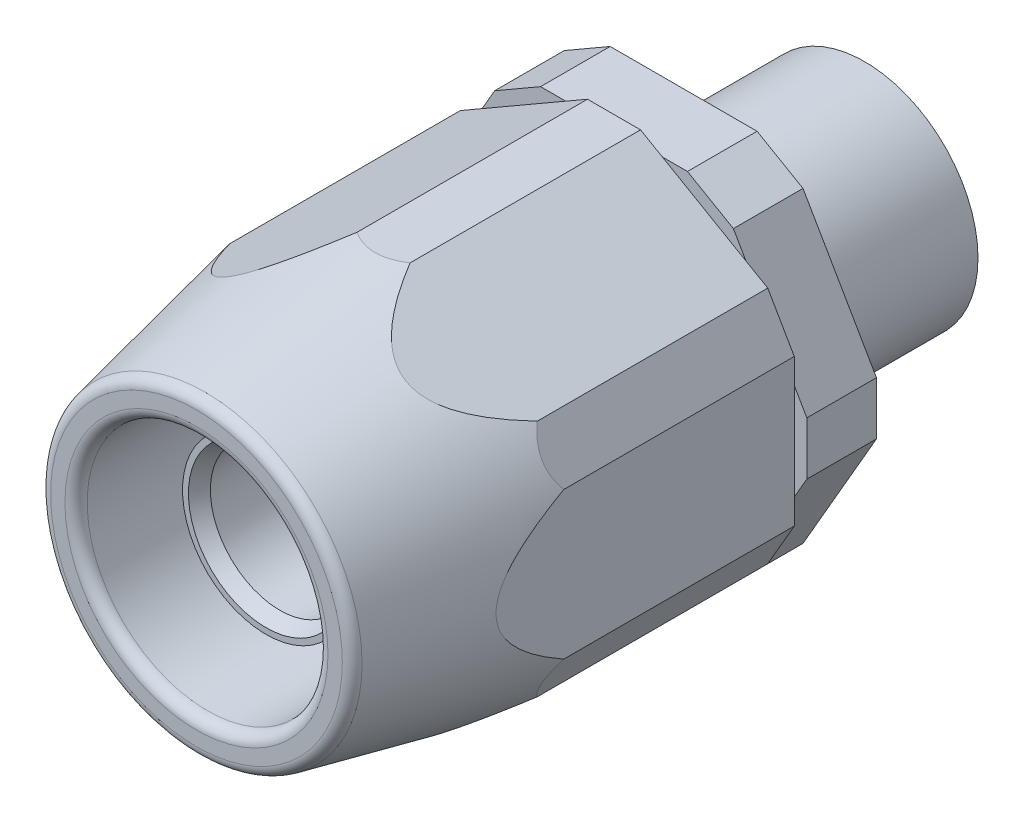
ISO-10303-21;
HEADER;
FILE_DESCRIPTION(('STEP AP214'),'2;1');
FILE_NAME('part.step','',(''),(''),'','','');
FILE_SCHEMA(('AUTOMOTIVE_DESIGN { 1 0 10303 214 1 1 1 1 }'));
ENDSEC;
DATA;
#1=APPLICATION_CONTEXT('core data for automotive mechanical design processes');
#2=APPLICATION_PROTOCOL_DEFINITION('international standard','automotive_design',2000,#1);
#3=PRODUCT_CONTEXT('',#1,'mechanical');
#4=PRODUCT('Part','Part','',(#3));
#5=PRODUCT_RELATED_PRODUCT_CATEGORY('part','',(#4));
#6=PRODUCT_DEFINITION_FORMATION('','',#4);
#7=PRODUCT_DEFINITION_CONTEXT('part definition',#1,'design');
#8=PRODUCT_DEFINITION('design','',#6,#7);
#9=PRODUCT_DEFINITION_SHAPE('','',#8);
#10=(LENGTH_UNIT() NAMED_UNIT(*) SI_UNIT(.MILLI.,.METRE.));
#11=(NAMED_UNIT(*) PLANE_ANGLE_UNIT() SI_UNIT($,.RADIAN.));
#12=(NAMED_UNIT(*) SI_UNIT($,.STERADIAN.) SOLID_ANGLE_UNIT());
#13=UNCERTAINTY_MEASURE_WITH_UNIT(LENGTH_MEASURE(1.E-05),#10,'distance_accuracy_value','');
#14=(GEOMETRIC_REPRESENTATION_CONTEXT(3) GLOBAL_UNCERTAINTY_ASSIGNED_CONTEXT((#13)) GLOBAL_UNIT_ASSIGNED_CONTEXT((#10,
#11,#12)) REPRESENTATION_CONTEXT('',''));
#15=CARTESIAN_POINT('',(0.,0.,0.));
#16=DIRECTION('',(0.,0.,1.));
#17=DIRECTION('',(1.,0.,0.));
#18=AXIS2_PLACEMENT_3D('',#15,#16,#17);
#19=CARTESIAN_POINT('',(1.45716771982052E-13,-1.66533453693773E-13,26.67));
#20=DIRECTION('',(0.,0.,1.));
#21=DIRECTION('',(1.,0.,0.));
#22=AXIS2_PLACEMENT_3D('',#19,#20,#21);
#23=CYLINDRICAL_SURFACE('',#22,7.62);
#24=CARTESIAN_POINT('',(1.45716771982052E-13,-1.66533453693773E-13,26.67));
#25=DIRECTION('',(0.,0.,1.));
#26=DIRECTION('',(1.,0.,0.));
#27=AXIS2_PLACEMENT_3D('',#24,#25,#26);
#28=CIRCLE('',#27,7.62);
#29=CARTESIAN_POINT('',(7.62000000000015,-1.73830116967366E-13,26.67));
#30=VERTEX_POINT('',#29);
#31=EDGE_CURVE('E512',#30,#30,#28,.T.);
#32=ORIENTED_EDGE('',*,*,#31,.T.);
#33=EDGE_LOOP('',(#32));
#34=FACE_BOUND('',#33,.T.);
#35=CARTESIAN_POINT('',(1.59594559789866E-13,-1.66533453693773E-13,38.1));
#36=DIRECTION('',(0.,0.,1.));
#37=DIRECTION('',(1.,0.,0.));
#38=AXIS2_PLACEMENT_3D('',#35,#36,#37);
#39=CIRCLE('',#38,7.62);
#40=CARTESIAN_POINT('',(7.62000000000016,-1.73830116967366E-13,38.1000000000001));
#41=VERTEX_POINT('',#40);
#42=EDGE_CURVE('E696',#41,#41,#39,.T.);
#43=ORIENTED_EDGE('',*,*,#42,.F.);
#44=EDGE_LOOP('',(#43));
#45=FACE_BOUND('',#44,.T.);
#46=ADVANCED_FACE('F26',(#34,#45),#23,.T.);
#47=CARTESIAN_POINT('',(-1.11022302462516E-13,0.,-16.51));
#48=DIRECTION('',(0.,0.,1.));
#49=DIRECTION('',(1.,0.,0.));
#50=AXIS2_PLACEMENT_3D('',#47,#48,#49);
#51=CYLINDRICAL_SURFACE('',#50,6.35);
#52=CARTESIAN_POINT('',(1.45716771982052E-13,-1.66533453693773E-13,36.83));
#53=DIRECTION('',(0.,0.,1.));
#54=DIRECTION('',(1.,0.,0.));
#55=AXIS2_PLACEMENT_3D('',#52,#53,#54);
#56=CIRCLE('',#55,6.35);
#57=CARTESIAN_POINT('',(6.35000000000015,-1.72614006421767E-13,36.83));
#58=VERTEX_POINT('',#57);
#59=EDGE_CURVE('E657',#58,#58,#56,.T.);
#60=ORIENTED_EDGE('',*,*,#59,.T.);
#61=EDGE_LOOP('',(#60));
#62=FACE_BOUND('',#61,.T.);
#63=CARTESIAN_POINT('',(-1.11022302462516E-13,0.,-16.51));
#64=DIRECTION('',(0.,0.,1.));
#65=DIRECTION('',(1.,0.,0.));
#66=AXIS2_PLACEMENT_3D('',#63,#64,#65);
#67=CIRCLE('',#66,6.35);
#68=CARTESIAN_POINT('',(6.34999999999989,0.,-16.51));
#69=VERTEX_POINT('',#68);
#70=EDGE_CURVE('E522',#69,#69,#67,.T.);
#71=ORIENTED_EDGE('',*,*,#70,.F.);
#72=EDGE_LOOP('',(#71));
#73=FACE_BOUND('',#72,.T.);
#74=ADVANCED_FACE('F487',(#62,#73),#51,.F.);
#75=CARTESIAN_POINT('',(16.4465000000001,9.49539120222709,44.4500000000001));
#76=DIRECTION('',(-0.499999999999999,-0.866025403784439,0.));
#77=DIRECTION('',(0.866025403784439,-0.500000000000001,0.));
#78=AXIS2_PLACEMENT_3D('',#75,#76,#77);
#79=PLANE('',#78);
#80=CARTESIAN_POINT('',(16.4465736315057,9.49534869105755,21.5898));
#81=CARTESIAN_POINT('',(16.3349600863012,9.55978880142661,21.8929320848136));
#82=CARTESIAN_POINT('',(16.2219233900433,9.62505056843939,22.1953724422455));
#83=CARTESIAN_POINT('',(15.9926258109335,9.75743558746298,22.7986465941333));
#84=CARTESIAN_POINT('',(15.8763646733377,9.8245589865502,23.099480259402));
#85=CARTESIAN_POINT('',(15.6400414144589,9.96100028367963,23.6998197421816));
#86=CARTESIAN_POINT('',(15.519972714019,10.0303219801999,23.9993221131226));
#87=CARTESIAN_POINT('',(15.2757806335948,10.1713063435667,24.5961090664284));
#88=CARTESIAN_POINT('',(15.1516573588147,10.2429689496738,24.8933937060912));
#89=CARTESIAN_POINT('',(14.8997959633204,10.3883811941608,25.4830204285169));
#90=CARTESIAN_POINT('',(14.7720938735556,10.4621100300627,25.7753829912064));
#91=CARTESIAN_POINT('',(14.5115021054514,10.6125627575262,26.3570072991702));
#92=CARTESIAN_POINT('',(14.3786125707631,10.689286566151,26.6462691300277));
#93=CARTESIAN_POINT('',(14.1069283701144,10.8461435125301,27.2208210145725));
#94=CARTESIAN_POINT('',(13.9681378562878,10.9262742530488,27.5061136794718));
#95=CARTESIAN_POINT('',(13.6835708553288,11.090569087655,28.0720014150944));
#96=CARTESIAN_POINT('',(13.537795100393,11.1747327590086,28.3525969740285));
#97=CARTESIAN_POINT('',(13.2874745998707,11.3192553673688,28.8161448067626));
#98=CARTESIAN_POINT('',(13.1852124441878,11.3782964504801,29.0007404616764));
#99=CARTESIAN_POINT('',(12.9764848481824,11.4988053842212,29.3667580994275));
#100=CARTESIAN_POINT('',(12.87001920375,11.5602733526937,29.5481799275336));
#101=CARTESIAN_POINT('',(12.651600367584,11.6863775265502,29.9083817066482));
#102=CARTESIAN_POINT('',(12.5396153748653,11.7510320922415,30.0871360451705));
#103=CARTESIAN_POINT('',(12.3101341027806,11.8835231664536,30.4398588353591));
#104=CARTESIAN_POINT('',(12.1926381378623,11.9513594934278,30.613827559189));
#105=CARTESIAN_POINT('',(11.9154615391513,12.1113874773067,31.006634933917));
#106=CARTESIAN_POINT('',(11.7536147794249,12.2048297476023,31.223457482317));
#107=CARTESIAN_POINT('',(11.4168840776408,12.3992413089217,31.6437117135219));
#108=CARTESIAN_POINT('',(11.2419878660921,12.5002176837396,31.8471304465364));
#109=CARTESIAN_POINT('',(10.8781910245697,12.7102558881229,32.2330891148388));
#110=CARTESIAN_POINT('',(10.6894205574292,12.8192425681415,32.4157902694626));
#111=CARTESIAN_POINT('',(10.2943063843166,13.0473618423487,32.7533580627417));
#112=CARTESIAN_POINT('',(10.0880103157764,13.1664669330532,32.9082968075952));
#113=CARTESIAN_POINT('',(9.7050515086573,13.3875683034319,33.1475096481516));
#114=CARTESIAN_POINT('',(9.53222534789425,13.4873495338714,33.2398402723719));
#115=CARTESIAN_POINT('',(9.17628991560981,13.692848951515,33.3928517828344));
#116=CARTESIAN_POINT('',(8.99319274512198,13.7985601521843,33.4535690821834));
#117=CARTESIAN_POINT('',(8.61864284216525,14.0148066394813,33.5368113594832));
#118=CARTESIAN_POINT('',(8.42712937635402,14.1253769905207,33.5589848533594));
#119=CARTESIAN_POINT('',(8.0438959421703,14.3466369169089,33.5607730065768));
#120=CARTESIAN_POINT('',(7.85217593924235,14.4573265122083,33.5403788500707));
#121=CARTESIAN_POINT('',(7.4939683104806,14.6641377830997,33.4640584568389));
#122=CARTESIAN_POINT('',(7.32686045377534,14.7606175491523,33.411845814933));
#123=CARTESIAN_POINT('',(7.0009443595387,14.9487852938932,33.2805361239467));
#124=CARTESIAN_POINT('',(6.84213814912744,15.0404721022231,33.2014325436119));
#125=CARTESIAN_POINT('',(6.41692963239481,15.2859663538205,32.9539409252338));
#126=CARTESIAN_POINT('',(6.1602566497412,15.4341565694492,32.7633351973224));
#127=CARTESIAN_POINT('',(5.79571616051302,15.6446241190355,32.4468621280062));
#128=CARTESIAN_POINT('',(5.67735295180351,15.712961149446,32.3359715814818));
#129=CARTESIAN_POINT('',(5.44679136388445,15.846075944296,32.105927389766));
#130=CARTESIAN_POINT('',(5.33459129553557,15.9108546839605,31.9867760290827));
#131=CARTESIAN_POINT('',(5.07109608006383,16.0629837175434,31.6919455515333));
#132=CARTESIAN_POINT('',(4.92252990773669,16.1487584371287,31.5130394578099));
#133=CARTESIAN_POINT('',(4.63469043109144,16.3149426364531,31.1454610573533));
#134=CARTESIAN_POINT('',(4.49542157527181,16.3953495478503,30.9567841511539));
#135=CARTESIAN_POINT('',(4.22460456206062,16.551705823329,30.5716698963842));
#136=CARTESIAN_POINT('',(4.09307047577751,16.6276470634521,30.3752194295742));
#137=CARTESIAN_POINT('',(3.83682078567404,16.7755928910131,29.9764562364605));
#138=CARTESIAN_POINT('',(3.71210641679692,16.8475967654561,29.7741424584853));
#139=CARTESIAN_POINT('',(3.34502470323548,17.0595314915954,29.1573727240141));
#140=CARTESIAN_POINT('',(3.11159082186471,17.1943046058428,28.7358268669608));
#141=CARTESIAN_POINT('',(2.66297993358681,17.4533102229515,27.8807589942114));
#142=CARTESIAN_POINT('',(2.44778484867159,17.5775531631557,27.4472494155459));
#143=CARTESIAN_POINT('',(2.0287927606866,17.8194583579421,26.5656559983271));
#144=CARTESIAN_POINT('',(1.82517990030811,17.937014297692,26.1174560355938));
#145=CARTESIAN_POINT('',(1.42949473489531,18.1654632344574,25.2141533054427));
#146=CARTESIAN_POINT('',(1.23742661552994,18.2763538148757,24.7590481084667));
#147=CARTESIAN_POINT('',(0.866860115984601,18.4903004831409,23.8535859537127));
#148=CARTESIAN_POINT('',(0.688157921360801,18.5934742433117,23.403339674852));
#149=CARTESIAN_POINT('',(0.338567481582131,18.7953103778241,22.4991615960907));
#150=CARTESIAN_POINT('',(0.167674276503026,18.8939756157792,22.0452323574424));
#151=CARTESIAN_POINT('',(-7.36315055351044E-05,18.990824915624,21.5898));
#152=B_SPLINE_CURVE_WITH_KNOTS('',3,(#80,#81,#82,#83,#84,#85,#86,#87,#88,#89,#90,#91,#92,#93,
#94,#95,#96,#97,#98,#99,#100,#101,#102,#103,#104,#105,#106,#107,#108,#109,#110,#111,#112,#113,
#114,#115,#116,#117,#118,#119,#120,#121,#122,#123,#124,#125,#126,#127,#128,#129,#130,#131,#132,
#133,#134,#135,#136,#137,#138,#139,#140,#141,#142,#143,#144,#145,#146,#147,#148,#149,#150,#151),
.UNSPECIFIED.,.F.,.F.,(4,2,2,2,2,2,2,2,2,2,2,2,2,2,2,2,2,2,2,2,2,2,2,2,2,2,2,2,2,2,2,2,2,2,2,4),
(0.,0.988181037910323,1.97644036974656,2.96651193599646,3.95655783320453,4.93883086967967,
5.92107672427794,6.90264251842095,7.88410564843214,8.54143899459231,9.19880429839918,
9.86054382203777,10.5222456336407,11.380437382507,12.239446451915,13.091230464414,
13.9407690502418,14.5983528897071,15.2551776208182,15.9179611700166,16.5808819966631,
17.1782400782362,17.7757433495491,18.8263462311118,19.3542066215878,19.8819216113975,
20.6249694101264,21.3683702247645,22.113084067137,22.8579323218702,24.3580719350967,
25.8567068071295,27.3747886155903,28.8934175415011,30.3791518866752,31.8639290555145),.UNSPECIFIED.);
#153=CARTESIAN_POINT('',(14.0268250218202,10.8923912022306,27.3832360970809));
#154=VERTEX_POINT('',#153);
#155=CARTESIAN_POINT('',(2.41967497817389,17.5937824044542,27.3832360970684));
#156=VERTEX_POINT('',#155);
#157=EDGE_CURVE('E571',#154,#156,#152,.T.);
#158=ORIENTED_EDGE('',*,*,#157,.F.);
#159=DIRECTION('',(0.,0.,-1.));
#160=VECTOR('',#159,1.);
#161=CARTESIAN_POINT('',(14.0268250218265,10.8923912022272,44.4500000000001));
#162=LINE('',#161,#160);
#163=CARTESIAN_POINT('',(14.0268250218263,10.8923912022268,6.35000000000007));
#164=VERTEX_POINT('',#163);
#165=EDGE_CURVE('E952',#154,#164,#162,.T.);
#166=ORIENTED_EDGE('',*,*,#165,.T.);
#167=DIRECTION('',(-0.866025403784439,0.500000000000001,0.));
#168=VECTOR('',#167,1.);
#169=CARTESIAN_POINT('',(16.4465000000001,9.49539120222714,6.35000000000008));
#170=LINE('',#169,#168);
#171=CARTESIAN_POINT('',(12.0396736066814,12.0396736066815,6.35000000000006));
#172=VERTEX_POINT('',#171);
#173=EDGE_CURVE('E256',#164,#172,#170,.T.);
#174=ORIENTED_EDGE('',*,*,#173,.T.);
#175=CARTESIAN_POINT('',(4.40682639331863,16.4464999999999,6.35000000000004));
#176=VERTEX_POINT('',#175);
#177=EDGE_CURVE('E329',#172,#176,#170,.T.);
#178=ORIENTED_EDGE('',*,*,#177,.T.);
#179=CARTESIAN_POINT('',(2.41967497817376,17.5937824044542,6.35000000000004));
#180=VERTEX_POINT('',#179);
#181=EDGE_CURVE('E967',#176,#180,#170,.T.);
#182=ORIENTED_EDGE('',*,*,#181,.T.);
#183=DIRECTION('',(0.,0.,1.));
#184=VECTOR('',#183,1.);
#185=CARTESIAN_POINT('',(2.4196749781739,17.5937824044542,44.45));
#186=LINE('',#185,#184);
#187=EDGE_CURVE('E951',#180,#156,#186,.T.);
#188=ORIENTED_EDGE('',*,*,#187,.T.);
#189=EDGE_LOOP('',(#158,#166,#174,#178,#182,#188));
#190=FACE_BOUND('',#189,.T.);
#191=ADVANCED_FACE('F493',(#190),#79,.F.);
#192=CARTESIAN_POINT('',(0.,18.9907824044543,44.4500000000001));
#193=DIRECTION('',(0.5,-0.86602540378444,0.));
#194=DIRECTION('',(0.866025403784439,0.499999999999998,0.));
#195=AXIS2_PLACEMENT_3D('',#192,#193,#194);
#196=PLANE('',#195);
#197=CARTESIAN_POINT('',(7.36315056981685E-05,18.9908249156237,21.5898));
#198=CARTESIAN_POINT('',(-0.111539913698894,18.9263848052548,21.8929320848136));
#199=CARTESIAN_POINT('',(-0.224576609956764,18.861123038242,22.1953724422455));
#200=CARTESIAN_POINT('',(-0.453874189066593,18.7287380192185,22.7986465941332));
#201=CARTESIAN_POINT('',(-0.570135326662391,18.6616146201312,23.0994802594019));
#202=CARTESIAN_POINT('',(-0.806458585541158,18.5251733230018,23.6998197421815));
#203=CARTESIAN_POINT('',(-0.92652728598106,18.4558516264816,23.9993221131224));
#204=CARTESIAN_POINT('',(-1.17071936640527,18.3148672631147,24.5961090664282));
#205=CARTESIAN_POINT('',(-1.29484264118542,18.2432046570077,24.8933937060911));
#206=CARTESIAN_POINT('',(-1.54670403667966,18.0977924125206,25.4830204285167));
#207=CARTESIAN_POINT('',(-1.67440612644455,18.0240635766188,25.7753829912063));
#208=CARTESIAN_POINT('',(-1.9349978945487,17.8736108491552,26.35700729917));
#209=CARTESIAN_POINT('',(-2.06788742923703,17.7968870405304,26.6462691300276));
#210=CARTESIAN_POINT('',(-2.33957162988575,17.6400300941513,27.2208210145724));
#211=CARTESIAN_POINT('',(-2.47836214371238,17.5598993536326,27.5061136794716));
#212=CARTESIAN_POINT('',(-2.76292914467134,17.3956045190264,28.0720014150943));
#213=CARTESIAN_POINT('',(-2.908704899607,17.3114408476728,28.3525969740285));
#214=CARTESIAN_POINT('',(-3.15902540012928,17.1669182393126,28.8161448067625));
#215=CARTESIAN_POINT('',(-3.26128755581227,17.1078771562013,29.0007404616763));
#216=CARTESIAN_POINT('',(-3.47001515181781,16.9873682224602,29.3667580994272));
#217=CARTESIAN_POINT('',(-3.57648079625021,16.9259002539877,29.5481799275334));
#218=CARTESIAN_POINT('',(-3.79489963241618,16.7997960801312,29.9083817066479));
#219=CARTESIAN_POINT('',(-3.90688462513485,16.7351415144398,30.0871360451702));
#220=CARTESIAN_POINT('',(-4.13636589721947,16.6026504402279,30.4398588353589));
#221=CARTESIAN_POINT('',(-4.25386186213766,16.5348141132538,30.6138275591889));
#222=CARTESIAN_POINT('',(-4.53103846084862,16.374786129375,31.006634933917));
#223=CARTESIAN_POINT('',(-4.69288522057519,16.2813438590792,31.2234574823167));
#224=CARTESIAN_POINT('',(-5.02961592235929,16.0869322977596,31.6437117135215));
#225=CARTESIAN_POINT('',(-5.204512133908,15.9859559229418,31.8471304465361));
#226=CARTESIAN_POINT('',(-5.56830897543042,15.7759177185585,32.2330891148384));
#227=CARTESIAN_POINT('',(-5.75707944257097,15.6669310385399,32.4157902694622));
#228=CARTESIAN_POINT('',(-6.15219361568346,15.4388117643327,32.7533580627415));
#229=CARTESIAN_POINT('',(-6.35848968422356,15.3197066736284,32.9082968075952));
#230=CARTESIAN_POINT('',(-6.74144849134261,15.0986053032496,33.1475096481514));
#231=CARTESIAN_POINT('',(-6.91427465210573,14.99882407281,33.2398402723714));
#232=CARTESIAN_POINT('',(-7.27021008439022,14.7933246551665,33.3928517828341));
#233=CARTESIAN_POINT('',(-7.45330725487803,14.6876134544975,33.4535690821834));
#234=CARTESIAN_POINT('',(-7.82785715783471,14.4713669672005,33.5368113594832));
#235=CARTESIAN_POINT('',(-8.01937062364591,14.3607966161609,33.558984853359));
#236=CARTESIAN_POINT('',(-8.40260405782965,14.1395366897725,33.5607730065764));
#237=CARTESIAN_POINT('',(-8.59432406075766,14.0288470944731,33.5403788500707));
#238=CARTESIAN_POINT('',(-8.95253168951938,13.8220358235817,33.4640584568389));
#239=CARTESIAN_POINT('',(-9.11963954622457,13.7255560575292,33.4118458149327));
#240=CARTESIAN_POINT('',(-9.4455556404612,13.5373883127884,33.2805361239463));
#241=CARTESIAN_POINT('',(-9.60436185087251,13.4457015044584,33.2014325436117));
#242=CARTESIAN_POINT('',(-10.0295703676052,13.200207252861,32.9539409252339));
#243=CARTESIAN_POINT('',(-10.2862433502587,13.0520170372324,32.7633351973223));
#244=CARTESIAN_POINT('',(-10.6507838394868,12.8415494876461,32.446862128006));
#245=CARTESIAN_POINT('',(-10.7691470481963,12.7732124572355,32.3359715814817));
#246=CARTESIAN_POINT('',(-10.9997086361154,12.6400976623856,32.1059273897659));
#247=CARTESIAN_POINT('',(-11.1119087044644,12.5753189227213,31.9867760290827));
#248=CARTESIAN_POINT('',(-11.3754039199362,12.4231898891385,31.6919455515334));
#249=CARTESIAN_POINT('',(-11.5239700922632,12.337415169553,31.5130394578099));
#250=CARTESIAN_POINT('',(-11.8118095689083,12.1712309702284,31.1454610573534));
#251=CARTESIAN_POINT('',(-11.951078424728,12.0908240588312,30.9567841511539));
#252=CARTESIAN_POINT('',(-12.2218954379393,11.9344677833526,30.5716698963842));
#253=CARTESIAN_POINT('',(-12.3534295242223,11.8585265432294,30.3752194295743));
#254=CARTESIAN_POINT('',(-12.6096792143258,11.7105807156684,29.9764562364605));
#255=CARTESIAN_POINT('',(-12.734393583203,11.6385768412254,29.7741424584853));
#256=CARTESIAN_POINT('',(-13.1014752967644,11.4266421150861,29.1573727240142));
#257=CARTESIAN_POINT('',(-13.3349091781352,11.2918690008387,28.735826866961));
#258=CARTESIAN_POINT('',(-13.7835200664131,11.0328633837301,27.8807589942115));
#259=CARTESIAN_POINT('',(-13.9987151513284,10.9086204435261,27.447249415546));
#260=CARTESIAN_POINT('',(-14.4177072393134,10.6667152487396,26.5656559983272));
#261=CARTESIAN_POINT('',(-14.6213200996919,10.5491593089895,26.1174560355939));
#262=CARTESIAN_POINT('',(-15.0170052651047,10.320710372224,25.2141533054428));
#263=CARTESIAN_POINT('',(-15.2090733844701,10.2098197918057,24.7590481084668));
#264=CARTESIAN_POINT('',(-15.5796398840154,9.99587312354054,23.8535859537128));
#265=CARTESIAN_POINT('',(-15.7583420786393,9.8926993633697,23.4033396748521));
#266=CARTESIAN_POINT('',(-16.1079325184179,9.69086322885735,22.4991615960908));
#267=CARTESIAN_POINT('',(-16.278825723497,9.59219799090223,22.0452323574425));
#268=CARTESIAN_POINT('',(-16.4465736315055,9.49534869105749,21.5898));
#269=B_SPLINE_CURVE_WITH_KNOTS('',3,(#197,#198,#199,#200,#201,#202,#203,#204,#205,#206,#207,
#208,#209,#210,#211,#212,#213,#214,#215,#216,#217,#218,#219,#220,#221,#222,#223,#224,#225,#226,
#227,#228,#229,#230,#231,#232,#233,#234,#235,#236,#237,#238,#239,#240,#241,#242,#243,#244,#245,
#246,#247,#248,#249,#250,#251,#252,#253,#254,#255,#256,#257,#258,#259,#260,#261,#262,#263,#264,
#265,#266,#267,#268),.UNSPECIFIED.,.F.,.F.,(4,2,2,2,2,2,2,2,2,2,2,2,2,2,2,2,2,2,2,2,2,2,2,2,2,2,
2,2,2,2,2,2,2,2,2,4),(0.,0.988181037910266,1.97644036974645,2.96651193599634,3.95655783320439,
4.93883086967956,5.92107672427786,6.90264251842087,7.88410564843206,8.5414389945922,
9.19880429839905,9.86054382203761,10.5222456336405,11.3804373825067,12.2394464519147,
13.0912304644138,13.9407690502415,14.5983528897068,15.2551776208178,15.9179611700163,
16.5808819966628,17.1782400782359,17.7757433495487,18.8263462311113,19.3542066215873,
19.8819216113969,20.6249694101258,21.3683702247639,22.1130840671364,22.8579323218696,
24.3580719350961,25.8567068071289,27.3747886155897,28.8934175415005,30.3791518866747,
31.8639290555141),.UNSPECIFIED.);
#270=CARTESIAN_POINT('',(-2.41967497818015,17.5937824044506,27.3832360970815));
#271=VERTEX_POINT('',#270);
#272=CARTESIAN_POINT('',(-14.0268250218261,10.8923912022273,27.3832360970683));
#273=VERTEX_POINT('',#272);
#274=EDGE_CURVE('E565',#271,#273,#269,.T.);
#275=ORIENTED_EDGE('',*,*,#274,.F.);
#276=DIRECTION('',(0.,0.,-1.));
#277=VECTOR('',#276,1.);
#278=CARTESIAN_POINT('',(-2.41967497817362,17.5937824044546,44.4500000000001));
#279=LINE('',#278,#277);
#280=CARTESIAN_POINT('',(-2.41967497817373,17.5937824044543,6.35000000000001));
#281=VERTEX_POINT('',#280);
#282=EDGE_CURVE('E964',#271,#281,#279,.T.);
#283=ORIENTED_EDGE('',*,*,#282,.T.);
#284=DIRECTION('',(-0.866025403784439,-0.499999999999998,0.));
#285=VECTOR('',#284,1.);
#286=CARTESIAN_POINT('',(0.,18.9907824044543,6.35000000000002));
#287=LINE('',#286,#285);
#288=CARTESIAN_POINT('',(-4.40682639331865,16.4464999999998,6.35000000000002));
#289=VERTEX_POINT('',#288);
#290=EDGE_CURVE('E255',#281,#289,#287,.T.);
#291=ORIENTED_EDGE('',*,*,#290,.T.);
#292=CARTESIAN_POINT('',(-12.0396736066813,12.0396736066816,6.34999999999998));
#293=VERTEX_POINT('',#292);
#294=EDGE_CURVE('E230',#289,#293,#287,.T.);
#295=ORIENTED_EDGE('',*,*,#294,.T.);
#296=CARTESIAN_POINT('',(-14.0268250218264,10.8923912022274,6.34999999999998));
#297=VERTEX_POINT('',#296);
#298=EDGE_CURVE('E250',#293,#297,#287,.T.);
#299=ORIENTED_EDGE('',*,*,#298,.T.);
#300=DIRECTION('',(0.,0.,1.));
#301=VECTOR('',#300,1.);
#302=CARTESIAN_POINT('',(-14.0268250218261,10.8923912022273,44.45));
#303=LINE('',#302,#301);
#304=EDGE_CURVE('E962',#297,#273,#303,.T.);
#305=ORIENTED_EDGE('',*,*,#304,.T.);
#306=EDGE_LOOP('',(#275,#283,#291,#295,#299,#305));
#307=FACE_BOUND('',#306,.T.);
#308=ADVANCED_FACE('F259',(#307),#196,.F.);
#309=CARTESIAN_POINT('',(-16.4464999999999,9.49539120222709,44.45));
#310=DIRECTION('',(1.,0.,0.));
#311=DIRECTION('',(0.,0.,-1.));
#312=AXIS2_PLACEMENT_3D('',#309,#310,#311);
#313=PLANE('',#312);
#314=CARTESIAN_POINT('',(-16.4465,-18.0281112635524,-3.87187929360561));
#315=CARTESIAN_POINT('',(-16.4464999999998,-17.8625139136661,-3.29633144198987));
#316=CARTESIAN_POINT('',(-16.4464999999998,-17.6959647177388,-2.72105772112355));
#317=CARTESIAN_POINT('',(-16.4464999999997,-17.3607896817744,-1.57111334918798));
#318=CARTESIAN_POINT('',(-16.4464999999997,-17.1921638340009,-0.996442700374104));
#319=CARTESIAN_POINT('',(-16.4464999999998,-16.6828757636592,0.726704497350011));
#320=CARTESIAN_POINT('',(-16.4464999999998,-16.3388399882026,1.87418749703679));
#321=CARTESIAN_POINT('',(-16.4464999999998,-15.6382601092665,4.17172188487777));
#322=CARTESIAN_POINT('',(-16.4464999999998,-15.2816612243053,5.32175658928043));
#323=CARTESIAN_POINT('',(-16.4464999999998,-14.5553367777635,7.61759867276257));
#324=CARTESIAN_POINT('',(-16.4464999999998,-14.1856121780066,8.76340635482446));
#325=CARTESIAN_POINT('',(-16.4464999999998,-13.5968441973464,10.5444188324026));
#326=CARTESIAN_POINT('',(-16.4464999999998,-13.3834226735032,11.1814831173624));
#327=CARTESIAN_POINT('',(-16.4464999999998,-12.9507661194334,12.4536340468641));
#328=CARTESIAN_POINT('',(-16.4464999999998,-12.7315311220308,13.0887207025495));
#329=CARTESIAN_POINT('',(-16.4464999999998,-12.2863220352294,14.3567125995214));
#330=CARTESIAN_POINT('',(-16.4464999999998,-12.0603462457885,14.9896172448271));
#331=CARTESIAN_POINT('',(-16.4464999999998,-11.6006237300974,16.2525965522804));
#332=CARTESIAN_POINT('',(-16.4464999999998,-11.3668770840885,16.8826712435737));
#333=CARTESIAN_POINT('',(-16.4464999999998,-10.890848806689,18.1377397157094));
#334=CARTESIAN_POINT('',(-16.4464999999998,-10.6485907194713,18.7627424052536));
#335=CARTESIAN_POINT('',(-16.4464999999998,-10.1532137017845,20.0084250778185));
#336=CARTESIAN_POINT('',(-16.4464999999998,-9.90009506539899,20.6291051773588));
#337=CARTESIAN_POINT('',(-16.4464999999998,-9.38075408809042,21.8646731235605));
#338=CARTESIAN_POINT('',(-16.4464999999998,-9.11453721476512,22.4795632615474));
#339=CARTESIAN_POINT('',(-16.4464999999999,-8.56575194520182,23.7019755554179));
#340=CARTESIAN_POINT('',(-16.4465,-8.2831856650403,24.3094986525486));
#341=CARTESIAN_POINT('',(-16.4464999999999,-7.84994747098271,25.2001289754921));
#342=CARTESIAN_POINT('',(-16.4464999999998,-7.70735328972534,25.4871705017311));
#343=CARTESIAN_POINT('',(-16.4464999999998,-7.41667057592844,26.0584777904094));
#344=CARTESIAN_POINT('',(-16.4464999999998,-7.26858187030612,26.3427434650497));
#345=CARTESIAN_POINT('',(-16.4464999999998,-6.96590563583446,26.9082945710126));
#346=CARTESIAN_POINT('',(-16.4464999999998,-6.81130962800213,27.1895754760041));
#347=CARTESIAN_POINT('',(-16.4464999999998,-6.49479904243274,27.747986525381));
#348=CARTESIAN_POINT('',(-16.4464999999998,-6.33288481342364,28.0251168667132));
#349=CARTESIAN_POINT('',(-16.4464999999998,-6.00301194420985,28.5699792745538));
#350=CARTESIAN_POINT('',(-16.4464999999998,-5.83518423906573,28.8377903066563));
#351=CARTESIAN_POINT('',(-16.4464999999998,-5.48966954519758,29.3669659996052));
#352=CARTESIAN_POINT('',(-16.4464999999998,-5.31198382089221,29.6283314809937));
#353=CARTESIAN_POINT('',(-16.4464999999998,-4.94510492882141,30.1421487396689));
#354=CARTESIAN_POINT('',(-16.4464999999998,-4.7559343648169,30.3946165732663));
#355=CARTESIAN_POINT('',(-16.4464999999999,-4.36331287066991,30.8881197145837));
#356=CARTESIAN_POINT('',(-16.4465,-4.15987066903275,31.1291618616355));
#357=CARTESIAN_POINT('',(-16.4464999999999,-3.8419929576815,31.4781837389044));
#358=CARTESIAN_POINT('',(-16.4464999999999,-3.73416946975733,31.5921934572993));
#359=CARTESIAN_POINT('',(-16.4464999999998,-3.51365591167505,31.8154382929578));
#360=CARTESIAN_POINT('',(-16.4464999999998,-3.40096551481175,31.9246730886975));
#361=CARTESIAN_POINT('',(-16.4464999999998,-3.16988666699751,32.1376446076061));
#362=CARTESIAN_POINT('',(-16.4464999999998,-3.05148370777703,32.2413657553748));
#363=CARTESIAN_POINT('',(-16.4464999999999,-2.80881524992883,32.4416177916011));
#364=CARTESIAN_POINT('',(-16.4464999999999,-2.6845496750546,32.5381485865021));
#365=CARTESIAN_POINT('',(-16.4465,-2.29772737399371,32.8177295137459));
#366=CARTESIAN_POINT('',(-16.4464999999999,-2.0247428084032,32.9873145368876));
#367=CARTESIAN_POINT('',(-16.4464999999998,-1.59521803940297,33.199655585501));
#368=CARTESIAN_POINT('',(-16.4464999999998,-1.44896721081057,33.2633570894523));
#369=CARTESIAN_POINT('',(-16.4464999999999,-1.15032145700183,33.374038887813));
#370=CARTESIAN_POINT('',(-16.4464999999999,-0.997932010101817,33.4210337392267));
#371=CARTESIAN_POINT('',(-16.4464999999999,-0.646348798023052,33.5056722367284));
#372=CARTESIAN_POINT('',(-16.4464999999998,-0.445653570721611,33.5373392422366));
#373=CARTESIAN_POINT('',(-16.4464999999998,-0.0418271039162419,33.565482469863));
#374=CARTESIAN_POINT('',(-16.4464999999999,0.161303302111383,33.5619704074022));
#375=CARTESIAN_POINT('',(-16.4464999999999,0.56344144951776,33.5202861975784));
#376=CARTESIAN_POINT('',(-16.4464999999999,0.762457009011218,33.4821874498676));
#377=CARTESIAN_POINT('',(-16.4464999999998,1.15207520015,33.3757190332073));
#378=CARTESIAN_POINT('',(-16.4464999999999,1.34267205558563,33.307328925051));
#379=CARTESIAN_POINT('',(-16.4465,1.81792844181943,33.1005248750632));
#380=CARTESIAN_POINT('',(-16.4464999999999,2.09483966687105,32.9443823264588));
#381=CARTESIAN_POINT('',(-16.4464999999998,2.48989300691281,32.6806382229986));
#382=CARTESIAN_POINT('',(-16.4464999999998,2.6184368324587,32.5875782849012));
#383=CARTESIAN_POINT('',(-16.4464999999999,2.86928705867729,32.3933613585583));
#384=CARTESIAN_POINT('',(-16.4464999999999,2.99159447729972,32.2922056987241));
#385=CARTESIAN_POINT('',(-16.4464999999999,3.26324112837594,32.0546829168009));
#386=CARTESIAN_POINT('',(-16.4464999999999,3.41078150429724,31.916273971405));
#387=CARTESIAN_POINT('',(-16.4464999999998,3.69766114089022,31.6311680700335));
#388=CARTESIAN_POINT('',(-16.4464999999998,3.8369971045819,31.4844678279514));
#389=CARTESIAN_POINT('',(-16.4464999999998,4.2446515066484,31.0342194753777));
#390=CARTESIAN_POINT('',(-16.4464999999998,4.5022026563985,30.720901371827));
#391=CARTESIAN_POINT('',(-16.4464999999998,4.87331881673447,30.2364946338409));
#392=CARTESIAN_POINT('',(-16.4464999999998,4.99519209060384,30.0715587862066));
#393=CARTESIAN_POINT('',(-16.4464999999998,5.2339157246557,29.7380611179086));
#394=CARTESIAN_POINT('',(-16.4464999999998,5.35076594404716,29.5694991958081));
#395=CARTESIAN_POINT('',(-16.4464999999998,5.57988212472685,29.2295713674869));
#396=CARTESIAN_POINT('',(-16.4464999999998,5.69215294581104,29.0582087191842));
#397=CARTESIAN_POINT('',(-16.4464999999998,5.91272060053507,28.7129575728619));
#398=CARTESIAN_POINT('',(-16.4464999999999,6.02101755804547,28.53906915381));
#399=CARTESIAN_POINT('',(-16.4465,6.36179900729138,27.9793537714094));
#400=CARTESIAN_POINT('',(-16.4464999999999,6.58750026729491,27.5893890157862));
#401=CARTESIAN_POINT('',(-16.4464999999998,7.02524932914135,26.8018380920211));
#402=CARTESIAN_POINT('',(-16.4464999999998,7.23729423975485,26.4042503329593));
#403=CARTESIAN_POINT('',(-16.4464999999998,7.65030836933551,25.6030462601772));
#404=CARTESIAN_POINT('',(-16.4464999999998,7.851270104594,25.1994261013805));
#405=CARTESIAN_POINT('',(-16.4464999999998,8.24384862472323,24.3876525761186));
#406=CARTESIAN_POINT('',(-16.4464999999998,8.43546480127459,23.979498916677));
#407=CARTESIAN_POINT('',(-16.4464999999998,8.81149791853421,23.158005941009));
#408=CARTESIAN_POINT('',(-16.4464999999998,8.99588447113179,22.7446527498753));
#409=CARTESIAN_POINT('',(-16.4464999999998,9.35781472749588,21.9149564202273));
#410=CARTESIAN_POINT('',(-16.4464999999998,9.53535823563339,21.498613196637));
#411=CARTESIAN_POINT('',(-16.4464999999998,10.0589857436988,20.2462397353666));
#412=CARTESIAN_POINT('',(-16.4464999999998,10.3962278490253,19.4065090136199));
#413=CARTESIAN_POINT('',(-16.4464999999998,11.0156969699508,17.8145759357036));
#414=CARTESIAN_POINT('',(-16.4464999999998,11.2998526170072,17.0631171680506));
#415=CARTESIAN_POINT('',(-16.4464999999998,11.8564340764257,15.5557749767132));
#416=CARTESIAN_POINT('',(-16.4464999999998,12.128858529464,14.7998910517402));
#417=CARTESIAN_POINT('',(-16.4464999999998,12.661795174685,13.2907561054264));
#418=CARTESIAN_POINT('',(-16.4464999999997,12.9223853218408,12.5375325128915));
#419=CARTESIAN_POINT('',(-16.4464999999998,13.4353140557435,11.0284375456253));
#420=CARTESIAN_POINT('',(-16.4464999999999,13.6876541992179,10.2725667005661));
#421=CARTESIAN_POINT('',(-16.4465,13.9365990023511,9.5155963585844));
#422=B_SPLINE_CURVE_WITH_KNOTS('',3,(#314,#315,#316,#317,#318,#319,#320,#321,#322,#323,#324,
#325,#326,#327,#328,#329,#330,#331,#332,#333,#334,#335,#336,#337,#338,#339,#340,#341,#342,#343,
#344,#345,#346,#347,#348,#349,#350,#351,#352,#353,#354,#355,#356,#357,#358,#359,#360,#361,#362,
#363,#364,#365,#366,#367,#368,#369,#370,#371,#372,#373,#374,#375,#376,#377,#378,#379,#380,#381,
#382,#383,#384,#385,#386,#387,#388,#389,#390,#391,#392,#393,#394,#395,#396,#397,#398,#399,#400,
#401,#402,#403,#404,#405,#406,#407,#408,#409,#410,#411,#412,#413,#414,#415,#416,#417,#418,#419,
#420,#421),.UNSPECIFIED.,.F.,.F.,(4,2,2,2,2,2,2,2,2,2,2,2,2,2,2,2,2,2,2,2,2,2,2,2,2,2,2,2,2,2,2,
2,2,2,2,2,2,2,2,2,2,2,2,2,2,2,2,2,2,2,2,2,2,4),(0.,1.79668979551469,3.59338628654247,
7.18718126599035,10.799279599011,14.4111137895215,16.42667969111,18.4422342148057,
20.4583014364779,22.474347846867,24.4851994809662,26.4959966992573,28.5059615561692,
30.515666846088,31.4771468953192,32.4386572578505,33.4014617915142,34.3642204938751,
35.3122006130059,36.2600594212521,37.206109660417,38.1515862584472,38.622227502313,
39.0929003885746,39.5648390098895,40.0367837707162,40.9955470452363,41.4733078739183,
41.9506513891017,42.5572331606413,43.1636129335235,43.7687088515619,44.3742136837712,
45.3220803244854,45.7979886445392,46.2738190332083,46.880302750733,47.4870285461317,
48.7021530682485,49.3173457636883,49.9325556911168,50.5470947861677,51.1616147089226,
52.5129271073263,53.864524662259,55.2170239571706,56.5696111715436,57.9273794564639,
59.2851865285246,61.9996269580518,64.4096946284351,66.8200408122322,69.2110748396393,
71.60165505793),.UNSPECIFIED.);
#423=CARTESIAN_POINT('',(-16.4464999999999,6.70139120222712,27.3832360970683));
#424=VERTEX_POINT('',#423);
#425=CARTESIAN_POINT('',(-16.4464999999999,-6.70139120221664,27.383236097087));
#426=VERTEX_POINT('',#425);
#427=EDGE_CURVE('E559',#424,#426,#422,.F.);
#428=ORIENTED_EDGE('',*,*,#427,.F.);
#429=DIRECTION('',(0.,0.,-1.));
#430=VECTOR('',#429,1.);
#431=CARTESIAN_POINT('',(-16.4464999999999,6.70139120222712,44.45));
#432=LINE('',#431,#430);
#433=CARTESIAN_POINT('',(-16.4465,6.70139120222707,6.34999999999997));
#434=VERTEX_POINT('',#433);
#435=EDGE_CURVE('E639',#424,#434,#432,.T.);
#436=ORIENTED_EDGE('',*,*,#435,.T.);
#437=DIRECTION('',(0.,-1.,0.));
#438=VECTOR('',#437,1.);
#439=CARTESIAN_POINT('',(-16.4465,9.49539120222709,6.34999999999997));
#440=LINE('',#439,#438);
#441=CARTESIAN_POINT('',(-16.4465000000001,4.40682639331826,6.34999999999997));
#442=VERTEX_POINT('',#441);
#443=EDGE_CURVE('E267',#434,#442,#440,.T.);
#444=ORIENTED_EDGE('',*,*,#443,.T.);
#445=CARTESIAN_POINT('',(-16.4465,-4.40682639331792,6.34999999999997));
#446=VERTEX_POINT('',#445);
#447=EDGE_CURVE('E262',#442,#446,#440,.T.);
#448=ORIENTED_EDGE('',*,*,#447,.T.);
#449=CARTESIAN_POINT('',(-16.4465,-6.70139120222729,6.34999999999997));
#450=VERTEX_POINT('',#449);
#451=EDGE_CURVE('E268',#446,#450,#440,.T.);
#452=ORIENTED_EDGE('',*,*,#451,.T.);
#453=DIRECTION('',(0.,0.,1.));
#454=VECTOR('',#453,1.);
#455=CARTESIAN_POINT('',(-16.4464999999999,-6.70139120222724,44.4499999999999));
#456=LINE('',#455,#454);
#457=EDGE_CURVE('E641',#450,#426,#456,.T.);
#458=ORIENTED_EDGE('',*,*,#457,.T.);
#459=EDGE_LOOP('',(#428,#436,#444,#448,#452,#458));
#460=FACE_BOUND('',#459,.T.);
#461=ADVANCED_FACE('F549',(#460),#313,.F.);
#462=CARTESIAN_POINT('',(-16.4464999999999,-9.49539120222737,44.4499999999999));
#463=DIRECTION('',(0.499999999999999,0.866025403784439,0.));
#464=DIRECTION('',(-0.86602540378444,0.500000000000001,0.));
#465=AXIS2_PLACEMENT_3D('',#462,#463,#464);
#466=PLANE('',#465);
#467=CARTESIAN_POINT('',(-16.4465736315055,-9.49534869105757,21.5897999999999));
#468=CARTESIAN_POINT('',(-16.3349600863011,-9.55978880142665,21.8929320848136));
#469=CARTESIAN_POINT('',(-16.2219233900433,-9.62505056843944,22.1953724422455));
#470=CARTESIAN_POINT('',(-15.9926258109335,-9.75743558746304,22.7986465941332));
#471=CARTESIAN_POINT('',(-15.8763646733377,-9.82455898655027,23.0994802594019));
#472=CARTESIAN_POINT('',(-15.6400414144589,-9.96100028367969,23.6998197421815));
#473=CARTESIAN_POINT('',(-15.519972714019,-10.0303219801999,23.9993221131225));
#474=CARTESIAN_POINT('',(-15.2757806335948,-10.1713063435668,24.5961090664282));
#475=CARTESIAN_POINT('',(-15.1516573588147,-10.2429689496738,24.8933937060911));
#476=CARTESIAN_POINT('',(-14.8997959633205,-10.3883811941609,25.4830204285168));
#477=CARTESIAN_POINT('',(-14.7720938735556,-10.4621100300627,25.7753829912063));
#478=CARTESIAN_POINT('',(-14.5115021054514,-10.6125627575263,26.3570072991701));
#479=CARTESIAN_POINT('',(-14.3786125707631,-10.689286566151,26.6462691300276));
#480=CARTESIAN_POINT('',(-14.1069283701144,-10.8461435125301,27.2208210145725));
#481=CARTESIAN_POINT('',(-13.9681378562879,-10.9262742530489,27.5061136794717));
#482=CARTESIAN_POINT('',(-13.6835708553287,-11.0905690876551,28.0720014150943));
#483=CARTESIAN_POINT('',(-13.5377951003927,-11.1747327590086,28.3525969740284));
#484=CARTESIAN_POINT('',(-13.2874745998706,-11.3192553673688,28.8161448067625));
#485=CARTESIAN_POINT('',(-13.1852124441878,-11.3782964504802,29.0007404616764));
#486=CARTESIAN_POINT('',(-12.9764848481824,-11.4988053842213,29.3667580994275));
#487=CARTESIAN_POINT('',(-12.8700192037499,-11.5602733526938,29.5481799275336));
#488=CARTESIAN_POINT('',(-12.651600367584,-11.6863775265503,29.9083817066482));
#489=CARTESIAN_POINT('',(-12.5396153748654,-11.7510320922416,30.0871360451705));
#490=CARTESIAN_POINT('',(-12.3101341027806,-11.8835231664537,30.4398588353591));
#491=CARTESIAN_POINT('',(-12.1926381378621,-11.951359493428,30.6138275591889));
#492=CARTESIAN_POINT('',(-11.9154615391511,-12.1113874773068,31.0066349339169));
#493=CARTESIAN_POINT('',(-11.7536147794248,-12.2048297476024,31.223457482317));
#494=CARTESIAN_POINT('',(-11.4168840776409,-12.3992413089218,31.643711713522));
#495=CARTESIAN_POINT('',(-11.2419878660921,-12.5002176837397,31.8471304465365));
#496=CARTESIAN_POINT('',(-10.8781910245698,-12.7102558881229,32.2330891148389));
#497=CARTESIAN_POINT('',(-10.6894205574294,-12.8192425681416,32.4157902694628));
#498=CARTESIAN_POINT('',(-10.2943063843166,-13.0473618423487,32.7533580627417));
#499=CARTESIAN_POINT('',(-10.0880103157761,-13.1664669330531,32.9082968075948));
#500=CARTESIAN_POINT('',(-9.70505150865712,-13.3875683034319,33.1475096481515));
#501=CARTESIAN_POINT('',(-9.53222534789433,-13.4873495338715,33.2398402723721));
#502=CARTESIAN_POINT('',(-9.1762899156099,-13.692848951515,33.3928517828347));
#503=CARTESIAN_POINT('',(-8.9931927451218,-13.7985601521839,33.4535690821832));
#504=CARTESIAN_POINT('',(-8.61864284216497,-14.014806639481,33.5368113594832));
#505=CARTESIAN_POINT('',(-8.42712937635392,-14.1253769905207,33.5589848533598));
#506=CARTESIAN_POINT('',(-8.04389594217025,-14.3466369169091,33.5607730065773));
#507=CARTESIAN_POINT('',(-7.85217593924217,-14.4573265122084,33.5403788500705));
#508=CARTESIAN_POINT('',(-7.49396831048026,-14.6641377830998,33.4640584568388));
#509=CARTESIAN_POINT('',(-7.32686045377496,-14.7606175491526,33.4118458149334));
#510=CARTESIAN_POINT('',(-7.00094435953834,-14.9487852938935,33.2805361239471));
#511=CARTESIAN_POINT('',(-6.84213814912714,-15.0404721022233,33.2014325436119));
#512=CARTESIAN_POINT('',(-6.41692963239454,-15.2859663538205,32.9539409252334));
#513=CARTESIAN_POINT('',(-6.16025664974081,-15.4341565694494,32.7633351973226));
#514=CARTESIAN_POINT('',(-5.79571616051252,-15.6446241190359,32.4468621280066));
#515=CARTESIAN_POINT('',(-5.67735295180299,-15.7129611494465,32.3359715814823));
#516=CARTESIAN_POINT('',(-5.44679136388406,-15.8460759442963,32.1059273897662));
#517=CARTESIAN_POINT('',(-5.33459129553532,-15.9108546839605,31.9867760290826));
#518=CARTESIAN_POINT('',(-5.07109608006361,-16.0629837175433,31.6919455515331));
#519=CARTESIAN_POINT('',(-4.92252990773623,-16.148758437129,31.51303945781));
#520=CARTESIAN_POINT('',(-4.63469043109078,-16.3149426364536,31.1454610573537));
#521=CARTESIAN_POINT('',(-4.49542157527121,-16.3953495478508,30.9567841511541));
#522=CARTESIAN_POINT('',(-4.22460456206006,-16.5517058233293,30.5716698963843));
#523=CARTESIAN_POINT('',(-4.09307047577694,-16.6276470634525,30.3752194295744));
#524=CARTESIAN_POINT('',(-3.83682078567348,-16.7755928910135,29.9764562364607));
#525=CARTESIAN_POINT('',(-3.71210641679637,-16.8475967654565,29.7741424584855));
#526=CARTESIAN_POINT('',(-3.34502470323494,-17.0595314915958,29.1573727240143));
#527=CARTESIAN_POINT('',(-3.11159082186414,-17.1943046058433,28.7358268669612));
#528=CARTESIAN_POINT('',(-2.66297993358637,-17.4533102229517,27.8807589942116));
#529=CARTESIAN_POINT('',(-2.44778484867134,-17.5775531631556,27.4472494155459));
#530=CARTESIAN_POINT('',(-2.02879276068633,-17.819458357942,26.5656559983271));
#531=CARTESIAN_POINT('',(-1.82517990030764,-17.9370142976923,26.1174560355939));
#532=CARTESIAN_POINT('',(-1.42949473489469,-18.1654632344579,25.214153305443));
#533=CARTESIAN_POINT('',(-1.23742661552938,-18.2763538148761,24.7590481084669));
#534=CARTESIAN_POINT('',(-0.866860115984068,-18.4903004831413,23.8535859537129));
#535=CARTESIAN_POINT('',(-0.68815792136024,-18.5934742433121,23.4033396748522));
#536=CARTESIAN_POINT('',(-0.338567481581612,-18.7953103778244,22.4991615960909));
#537=CARTESIAN_POINT('',(-0.167674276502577,-18.8939756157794,22.0452323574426));
#538=CARTESIAN_POINT('',(7.36315057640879E-05,-18.990824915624,21.5898));
#539=B_SPLINE_CURVE_WITH_KNOTS('',3,(#467,#468,#469,#470,#471,#472,#473,#474,#475,#476,#477,
#478,#479,#480,#481,#482,#483,#484,#485,#486,#487,#488,#489,#490,#491,#492,#493,#494,#495,#496,
#497,#498,#499,#500,#501,#502,#503,#504,#505,#506,#507,#508,#509,#510,#511,#512,#513,#514,#515,
#516,#517,#518,#519,#520,#521,#522,#523,#524,#525,#526,#527,#528,#529,#530,#531,#532,#533,#534,
#535,#536,#537,#538),.UNSPECIFIED.,.F.,.F.,(4,2,2,2,2,2,2,2,2,2,2,2,2,2,2,2,2,2,2,2,2,2,2,2,2,2,
2,2,2,2,2,2,2,2,2,4),(0.,0.988181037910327,1.97644036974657,2.96651193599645,3.95655783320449,
4.93883086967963,5.92107672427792,6.90264251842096,7.88410564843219,8.54143899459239,
9.19880429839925,9.86054382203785,10.5222456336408,11.3804373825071,12.2394464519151,
13.091230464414,13.9407690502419,14.5983528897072,15.2551776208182,15.9179611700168,
16.5808819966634,17.1782400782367,17.7757433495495,18.8263462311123,19.3542066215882,
19.881921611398,20.624969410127,21.3683702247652,22.1130840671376,22.8579323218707,
24.3580719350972,25.8567068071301,27.3747886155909,28.8934175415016,30.3791518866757,
31.8639290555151),.UNSPECIFIED.);
#540=CARTESIAN_POINT('',(-14.0268250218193,-10.8923912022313,27.3832360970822));
#541=VERTEX_POINT('',#540);
#542=CARTESIAN_POINT('',(-2.41967497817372,-17.5937824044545,27.3832360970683));
#543=VERTEX_POINT('',#542);
#544=EDGE_CURVE('E553',#541,#543,#539,.T.);
#545=ORIENTED_EDGE('',*,*,#544,.F.);
#546=DIRECTION('',(0.,0.,-1.));
#547=VECTOR('',#546,1.);
#548=CARTESIAN_POINT('',(-14.0268250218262,-10.8923912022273,44.4499999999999));
#549=LINE('',#548,#547);
#550=CARTESIAN_POINT('',(-14.0268250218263,-10.8923912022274,6.34999999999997));
#551=VERTEX_POINT('',#550);
#552=EDGE_CURVE('E650',#541,#551,#549,.T.);
#553=ORIENTED_EDGE('',*,*,#552,.T.);
#554=DIRECTION('',(0.866025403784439,-0.5,0.));
#555=VECTOR('',#554,1.);
#556=CARTESIAN_POINT('',(-16.4465000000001,-9.49539120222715,6.34999999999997));
#557=LINE('',#556,#555);
#558=CARTESIAN_POINT('',(-12.0396736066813,-12.0396736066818,6.34999999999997));
#559=VERTEX_POINT('',#558);
#560=EDGE_CURVE('E278',#551,#559,#557,.T.);
#561=ORIENTED_EDGE('',*,*,#560,.T.);
#562=CARTESIAN_POINT('',(-4.40682639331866,-16.4465,6.35));
#563=VERTEX_POINT('',#562);
#564=EDGE_CURVE('E265',#559,#563,#557,.T.);
#565=ORIENTED_EDGE('',*,*,#564,.T.);
#566=CARTESIAN_POINT('',(-2.41967497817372,-17.5937824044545,6.34999999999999));
#567=VERTEX_POINT('',#566);
#568=EDGE_CURVE('E276',#563,#567,#557,.T.);
#569=ORIENTED_EDGE('',*,*,#568,.T.);
#570=DIRECTION('',(0.,0.,1.));
#571=VECTOR('',#570,1.);
#572=CARTESIAN_POINT('',(-2.41967497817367,-17.5937824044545,44.45));
#573=LINE('',#572,#571);
#574=EDGE_CURVE('E643',#567,#543,#573,.T.);
#575=ORIENTED_EDGE('',*,*,#574,.T.);
#576=EDGE_LOOP('',(#545,#553,#561,#565,#569,#575));
#577=FACE_BOUND('',#576,.T.);
#578=ADVANCED_FACE('F544',(#577),#466,.F.);
#579=CARTESIAN_POINT('',(1.52655665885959E-13,-18.9907824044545,44.45));
#580=DIRECTION('',(-0.500000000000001,0.86602540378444,0.));
#581=DIRECTION('',(-0.866025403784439,-0.499999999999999,0.));
#582=AXIS2_PLACEMENT_3D('',#579,#580,#581);
#583=PLANE('',#582);
#584=DIRECTION('',(0.866025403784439,0.499999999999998,0.));
#585=VECTOR('',#584,1.);
#586=CARTESIAN_POINT('',(0.,-18.9907824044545,6.35000000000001));
#587=LINE('',#586,#585);
#588=CARTESIAN_POINT('',(12.0396736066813,-12.0396736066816,6.35000000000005));
#589=VERTEX_POINT('',#588);
#590=CARTESIAN_POINT('',(14.0268250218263,-10.8923912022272,6.35000000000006));
#591=VERTEX_POINT('',#590);
#592=EDGE_CURVE('E280',#589,#591,#587,.T.);
#593=ORIENTED_EDGE('',*,*,#592,.T.);
#594=DIRECTION('',(0.,0.,1.));
#595=VECTOR('',#594,1.);
#596=CARTESIAN_POINT('',(14.0268250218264,-10.892391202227,44.45));
#597=LINE('',#596,#595);
#598=CARTESIAN_POINT('',(14.0268250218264,-10.892391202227,27.3832360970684));
#599=VERTEX_POINT('',#598);
#600=EDGE_CURVE('E389',#591,#599,#597,.T.);
#601=ORIENTED_EDGE('',*,*,#600,.T.);
#602=CARTESIAN_POINT('',(-7.36315055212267E-05,-18.990824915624,21.5898));
#603=CARTESIAN_POINT('',(0.111539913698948,-18.9263848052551,21.8929320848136));
#604=CARTESIAN_POINT('',(0.224576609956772,-18.8611230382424,22.1953724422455));
#605=CARTESIAN_POINT('',(0.453874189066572,-18.7287380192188,22.7986465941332));
#606=CARTESIAN_POINT('',(0.570135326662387,-18.6616146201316,23.099480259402));
#607=CARTESIAN_POINT('',(0.806458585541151,-18.5251733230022,23.6998197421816));
#608=CARTESIAN_POINT('',(0.926527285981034,-18.4558516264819,23.9993221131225));
#609=CARTESIAN_POINT('',(1.17071936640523,-18.3148672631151,24.5961090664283));
#610=CARTESIAN_POINT('',(1.29484264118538,-18.243204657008,24.8933937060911));
#611=CARTESIAN_POINT('',(1.54670403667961,-18.097792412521,25.4830204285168));
#612=CARTESIAN_POINT('',(1.67440612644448,-18.0240635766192,25.7753829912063));
#613=CARTESIAN_POINT('',(1.93499789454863,-17.8736108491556,26.3570072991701));
#614=CARTESIAN_POINT('',(2.06788742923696,-17.7968870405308,26.6462691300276));
#615=CARTESIAN_POINT('',(2.33957162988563,-17.6400300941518,27.2208210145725));
#616=CARTESIAN_POINT('',(2.4783621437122,-17.559899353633,27.5061136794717));
#617=CARTESIAN_POINT('',(2.7629291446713,-17.3956045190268,28.0720014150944));
#618=CARTESIAN_POINT('',(2.90870489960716,-17.3114408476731,28.3525969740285));
#619=CARTESIAN_POINT('',(3.15902540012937,-17.166918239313,28.8161448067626));
#620=CARTESIAN_POINT('',(3.26128755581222,-17.1078771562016,29.0007404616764));
#621=CARTESIAN_POINT('',(3.47001515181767,-16.9873682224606,29.3667580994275));
#622=CARTESIAN_POINT('',(3.57648079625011,-16.9259002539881,29.5481799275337));
#623=CARTESIAN_POINT('',(3.79489963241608,-16.7997960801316,29.9083817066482));
#624=CARTESIAN_POINT('',(3.9068846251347,-16.7351415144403,30.0871360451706));
#625=CARTESIAN_POINT('',(4.13636589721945,-16.6026504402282,30.4398588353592));
#626=CARTESIAN_POINT('',(4.25386186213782,-16.5348141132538,30.613827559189));
#627=CARTESIAN_POINT('',(4.53103846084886,-16.3747861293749,31.006634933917));
#628=CARTESIAN_POINT('',(4.69288522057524,-16.2813438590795,31.2234574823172));
#629=CARTESIAN_POINT('',(5.02961592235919,-16.0869322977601,31.6437117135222));
#630=CARTESIAN_POINT('',(5.20451213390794,-15.9859559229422,31.8471304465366));
#631=CARTESIAN_POINT('',(5.5683089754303,-15.7759177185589,32.233089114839));
#632=CARTESIAN_POINT('',(5.75707944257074,-15.6669310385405,32.4157902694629));
#633=CARTESIAN_POINT('',(6.15219361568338,-15.438811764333,32.7533580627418));
#634=CARTESIAN_POINT('',(6.35848968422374,-15.3197066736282,32.9082968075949));
#635=CARTESIAN_POINT('',(6.74144849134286,-15.0986053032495,33.1475096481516));
#636=CARTESIAN_POINT('',(6.91427465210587,-14.9988240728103,33.2398402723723));
#637=CARTESIAN_POINT('',(7.27021008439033,-14.7933246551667,33.3928517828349));
#638=CARTESIAN_POINT('',(7.45330725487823,-14.6876134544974,33.4535690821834));
#639=CARTESIAN_POINT('',(7.82785715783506,-14.4713669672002,33.5368113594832));
#640=CARTESIAN_POINT('',(8.01937062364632,-14.360796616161,33.5589848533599));
#641=CARTESIAN_POINT('',(8.40260405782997,-14.1395366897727,33.5607730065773));
#642=CARTESIAN_POINT('',(8.59432406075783,-14.0288470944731,33.5403788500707));
#643=CARTESIAN_POINT('',(8.95253168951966,-13.8220358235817,33.4640584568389));
#644=CARTESIAN_POINT('',(9.11963954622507,-13.7255560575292,33.4118458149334));
#645=CARTESIAN_POINT('',(9.44555564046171,-13.5373883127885,33.2805361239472));
#646=CARTESIAN_POINT('',(9.60436185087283,-13.4457015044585,33.201432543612));
#647=CARTESIAN_POINT('',(10.0295703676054,-13.2002072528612,32.9539409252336));
#648=CARTESIAN_POINT('',(10.2862433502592,-13.0520170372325,32.7633351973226));
#649=CARTESIAN_POINT('',(10.6507838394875,-12.841549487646,32.4468621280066));
#650=CARTESIAN_POINT('',(10.769147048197,-12.7732124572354,32.3359715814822));
#651=CARTESIAN_POINT('',(10.999708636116,-12.6400976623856,32.1059273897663));
#652=CARTESIAN_POINT('',(11.1119087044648,-12.5753189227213,31.9867760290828));
#653=CARTESIAN_POINT('',(11.3754039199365,-12.4231898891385,31.6919455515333));
#654=CARTESIAN_POINT('',(11.5239700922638,-12.3374151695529,31.5130394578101));
#655=CARTESIAN_POINT('',(11.8118095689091,-12.1712309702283,31.1454610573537));
#656=CARTESIAN_POINT('',(11.9510784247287,-12.0908240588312,30.9567841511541));
#657=CARTESIAN_POINT('',(12.2218954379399,-11.9344677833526,30.5716698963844));
#658=CARTESIAN_POINT('',(12.353429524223,-11.8585265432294,30.3752194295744));
#659=CARTESIAN_POINT('',(12.6096792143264,-11.7105807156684,29.9764562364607));
#660=CARTESIAN_POINT('',(12.7343935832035,-11.6385768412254,29.7741424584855));
#661=CARTESIAN_POINT('',(13.1014752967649,-11.4266421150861,29.1573727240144));
#662=CARTESIAN_POINT('',(13.3349091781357,-11.2918690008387,28.7358268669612));
#663=CARTESIAN_POINT('',(13.7835200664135,-11.0328633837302,27.8807589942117));
#664=CARTESIAN_POINT('',(13.9987151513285,-10.9086204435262,27.447249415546));
#665=CARTESIAN_POINT('',(14.4177072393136,-10.6667152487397,26.5656559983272));
#666=CARTESIAN_POINT('',(14.6213200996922,-10.5491593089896,26.117456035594));
#667=CARTESIAN_POINT('',(15.0170052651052,-10.3207103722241,25.214153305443));
#668=CARTESIAN_POINT('',(15.2090733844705,-10.2098197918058,24.7590481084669));
#669=CARTESIAN_POINT('',(15.5796398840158,-9.99587312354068,23.8535859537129));
#670=CARTESIAN_POINT('',(15.7583420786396,-9.89269936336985,23.4033396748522));
#671=CARTESIAN_POINT('',(16.1079325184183,-9.69086322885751,22.4991615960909));
#672=CARTESIAN_POINT('',(16.2788257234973,-9.5921979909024,22.0452323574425));
#673=CARTESIAN_POINT('',(16.4465736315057,-9.49534869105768,21.5898));
#674=B_SPLINE_CURVE_WITH_KNOTS('',3,(#602,#603,#604,#605,#606,#607,#608,#609,#610,#611,#612,
#613,#614,#615,#616,#617,#618,#619,#620,#621,#622,#623,#624,#625,#626,#627,#628,#629,#630,#631,
#632,#633,#634,#635,#636,#637,#638,#639,#640,#641,#642,#643,#644,#645,#646,#647,#648,#649,#650,
#651,#652,#653,#654,#655,#656,#657,#658,#659,#660,#661,#662,#663,#664,#665,#666,#667,#668,#669,
#670,#671,#672,#673),.UNSPECIFIED.,.F.,.F.,(4,2,2,2,2,2,2,2,2,2,2,2,2,2,2,2,2,2,2,2,2,2,2,2,2,2,
2,2,2,2,2,2,2,2,2,4),(0.,0.988181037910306,1.97644036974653,2.96651193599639,3.95655783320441,
4.93883086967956,5.92107672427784,6.90264251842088,7.88410564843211,8.54143899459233,
9.19880429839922,9.86054382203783,10.5222456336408,11.3804373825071,12.2394464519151,
13.0912304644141,13.940769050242,14.5983528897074,15.2551776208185,15.917961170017,
16.5808819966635,17.1782400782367,17.7757433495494,18.8263462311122,19.3542066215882,
19.8819216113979,20.6249694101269,21.3683702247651,22.1130840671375,22.8579323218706,
24.3580719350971,25.8567068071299,27.3747886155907,28.8934175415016,30.3791518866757,
31.8639290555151),.UNSPECIFIED.);
#675=CARTESIAN_POINT('',(2.4196749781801,-17.5937824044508,27.3832360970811));
#676=VERTEX_POINT('',#675);
#677=EDGE_CURVE('E520',#676,#599,#674,.T.);
#678=ORIENTED_EDGE('',*,*,#677,.F.);
#679=DIRECTION('',(0.,0.,-1.));
#680=VECTOR('',#679,1.);
#681=CARTESIAN_POINT('',(2.41967497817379,-17.5937824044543,44.45));
#682=LINE('',#681,#680);
#683=CARTESIAN_POINT('',(2.41967497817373,-17.5937824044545,6.35000000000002));
#684=VERTEX_POINT('',#683);
#685=EDGE_CURVE('E386',#676,#684,#682,.T.);
#686=ORIENTED_EDGE('',*,*,#685,.T.);
#687=CARTESIAN_POINT('',(4.40682639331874,-16.4465,6.35000000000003));
#688=VERTEX_POINT('',#687);
#689=EDGE_CURVE('E281',#684,#688,#587,.T.);
#690=ORIENTED_EDGE('',*,*,#689,.T.);
#691=EDGE_CURVE('E284',#688,#589,#587,.T.);
#692=ORIENTED_EDGE('',*,*,#691,.T.);
#693=EDGE_LOOP('',(#593,#601,#678,#686,#690,#692));
#694=FACE_BOUND('',#693,.T.);
#695=ADVANCED_FACE('F539',(#694),#583,.F.);
#696=CARTESIAN_POINT('',(16.4465000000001,-9.49539120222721,44.45));
#697=DIRECTION('',(-0.999999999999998,0.,0.));
#698=DIRECTION('',(0.,-1.,0.));
#699=AXIS2_PLACEMENT_3D('',#696,#697,#698);
#700=PLANE('',#699);
#701=CARTESIAN_POINT('',(16.4465000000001,-18.0281112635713,-3.87187929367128));
#702=CARTESIAN_POINT('',(16.4465000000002,-17.8625139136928,-3.29633144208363));
#703=CARTESIAN_POINT('',(16.4465000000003,-17.6959647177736,-2.72105772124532));
#704=CARTESIAN_POINT('',(16.4465000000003,-17.3607896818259,-1.57111334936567));
#705=CARTESIAN_POINT('',(16.4465000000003,-17.1921638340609,-0.996442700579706));
#706=CARTESIAN_POINT('',(16.4465000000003,-16.6828757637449,0.726704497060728));
#707=CARTESIAN_POINT('',(16.4465000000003,-16.338839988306,1.87418749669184));
#708=CARTESIAN_POINT('',(16.4465000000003,-15.6382601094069,4.17172188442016));
#709=CARTESIAN_POINT('',(16.4465000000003,-15.2816612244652,5.32175658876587));
#710=CARTESIAN_POINT('',(16.4465000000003,-14.5553367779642,7.61759867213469));
#711=CARTESIAN_POINT('',(16.4465000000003,-14.1856121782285,8.76340635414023));
#712=CARTESIAN_POINT('',(16.4465000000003,-13.5968441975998,10.5444188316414));
#713=CARTESIAN_POINT('',(16.4465000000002,-13.3834226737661,11.1814831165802));
#714=CARTESIAN_POINT('',(16.4465000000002,-12.9507661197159,12.4536340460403));
#715=CARTESIAN_POINT('',(16.4465000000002,-12.7315311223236,13.088720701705));
#716=CARTESIAN_POINT('',(16.4465000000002,-12.2863220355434,14.3567125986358));
#717=CARTESIAN_POINT('',(16.4465000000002,-12.0603462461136,14.9896172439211));
#718=CARTESIAN_POINT('',(16.4465000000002,-11.6006237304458,16.2525965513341));
#719=CARTESIAN_POINT('',(16.4465000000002,-11.3668770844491,16.8826712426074));
#720=CARTESIAN_POINT('',(16.4465000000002,-10.8908488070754,18.1377397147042));
#721=CARTESIAN_POINT('',(16.4465000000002,-10.6485907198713,18.7627424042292));
#722=CARTESIAN_POINT('',(16.4465000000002,-10.1532137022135,20.008425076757));
#723=CARTESIAN_POINT('',(16.4465000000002,-9.90009506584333,20.629105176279));
#724=CARTESIAN_POINT('',(16.4465000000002,-9.38075408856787,21.8646731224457));
#725=CARTESIAN_POINT('',(16.4465000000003,-9.11453721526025,22.4795632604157));
#726=CARTESIAN_POINT('',(16.4465000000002,-8.56575194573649,23.7019755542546));
#727=CARTESIAN_POINT('',(16.4465,-8.28318566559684,24.3094986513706));
#728=CARTESIAN_POINT('',(16.4465000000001,-7.84994747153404,25.2001289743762));
#729=CARTESIAN_POINT('',(16.4465000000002,-7.70735329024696,25.4871705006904));
#730=CARTESIAN_POINT('',(16.4465000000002,-7.41667057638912,26.0584777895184));
#731=CARTESIAN_POINT('',(16.4465000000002,-7.26858187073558,26.3427434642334));
#732=CARTESIAN_POINT('',(16.4465000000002,-6.96590563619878,26.9082945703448));
#733=CARTESIAN_POINT('',(16.4465000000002,-6.81130962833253,27.18957547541));
#734=CARTESIAN_POINT('',(16.4465000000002,-6.49479904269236,27.7479865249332));
#735=CARTESIAN_POINT('',(16.4465000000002,-6.3328848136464,28.0251168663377));
#736=CARTESIAN_POINT('',(16.4465000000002,-6.00301194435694,28.5699792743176));
#737=CARTESIAN_POINT('',(16.4465000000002,-5.83518423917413,28.837790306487));
#738=CARTESIAN_POINT('',(16.4465000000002,-5.48966954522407,29.3669659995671));
#739=CARTESIAN_POINT('',(16.4465000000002,-5.31198382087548,29.6283314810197));
#740=CARTESIAN_POINT('',(16.4465000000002,-4.9451049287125,30.1421487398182));
#741=CARTESIAN_POINT('',(16.4465000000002,-4.75593436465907,30.3946165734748));
#742=CARTESIAN_POINT('',(16.4465000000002,-4.36331287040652,30.8881197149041));
#743=CARTESIAN_POINT('',(16.4465000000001,-4.15987066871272,31.1291618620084));
#744=CARTESIAN_POINT('',(16.4465000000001,-3.84199295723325,31.4781837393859));
#745=CARTESIAN_POINT('',(16.4465000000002,-3.7341694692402,31.59219345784));
#746=CARTESIAN_POINT('',(16.4465000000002,-3.51365591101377,31.8154382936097));
#747=CARTESIAN_POINT('',(16.4465000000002,-3.4009655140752,31.9246730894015));
#748=CARTESIAN_POINT('',(16.4465000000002,-3.16988666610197,32.1376446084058));
#749=CARTESIAN_POINT('',(16.4465000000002,-3.05148370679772,32.2413657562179));
#750=CARTESIAN_POINT('',(16.4465000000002,-2.80881524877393,32.4416177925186));
#751=CARTESIAN_POINT('',(16.4465000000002,-2.68454967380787,32.5381485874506));
#752=CARTESIAN_POINT('',(16.4465000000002,-2.29772737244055,32.8177295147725));
#753=CARTESIAN_POINT('',(16.4465000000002,-2.02474280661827,32.9873145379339));
#754=CARTESIAN_POINT('',(16.4465000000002,-1.59521803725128,33.199655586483));
#755=CARTESIAN_POINT('',(16.4465000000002,-1.44896720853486,33.2633570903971));
#756=CARTESIAN_POINT('',(16.4465000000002,-1.15032145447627,33.3740388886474));
#757=CARTESIAN_POINT('',(16.4465000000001,-0.997932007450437,33.4210337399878));
#758=CARTESIAN_POINT('',(16.4465000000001,-0.646348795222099,33.5056722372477));
#759=CARTESIAN_POINT('',(16.4465000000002,-0.445653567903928,33.5373392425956));
#760=CARTESIAN_POINT('',(16.4465000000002,-0.0418271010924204,33.5654824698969));
#761=CARTESIAN_POINT('',(16.4465000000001,0.161303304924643,33.561970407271));
#762=CARTESIAN_POINT('',(16.4465000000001,0.563441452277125,33.5202861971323));
#763=CARTESIAN_POINT('',(16.4465000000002,0.762457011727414,33.4821874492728));
#764=CARTESIAN_POINT('',(16.4465000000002,1.15207520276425,33.3757190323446));
#765=CARTESIAN_POINT('',(16.4465000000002,1.3426720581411,33.3073289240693));
#766=CARTESIAN_POINT('',(16.4465000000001,1.81792844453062,33.1005248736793));
#767=CARTESIAN_POINT('',(16.4465000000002,2.09483966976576,32.9443823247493));
#768=CARTESIAN_POINT('',(16.4465000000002,2.48989301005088,32.6806382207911));
#769=CARTESIAN_POINT('',(16.4465000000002,2.61843683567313,32.5875782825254));
#770=CARTESIAN_POINT('',(16.4465000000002,2.86928706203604,32.3933613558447));
#771=CARTESIAN_POINT('',(16.4465000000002,2.99159448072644,32.2922056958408));
#772=CARTESIAN_POINT('',(16.4465000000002,3.26324113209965,32.0546829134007));
#773=CARTESIAN_POINT('',(16.4465000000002,3.41078150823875,31.9162739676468));
#774=CARTESIAN_POINT('',(16.4465000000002,3.69766114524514,31.6311680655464));
#775=CARTESIAN_POINT('',(16.4465000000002,3.83699710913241,31.4844678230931));
#776=CARTESIAN_POINT('',(16.4465000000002,4.24465151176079,31.0342194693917));
#777=CARTESIAN_POINT('',(16.4465000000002,4.50220266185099,30.7209013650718));
#778=CARTESIAN_POINT('',(16.4465000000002,4.87331882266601,30.2364946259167));
#779=CARTESIAN_POINT('',(16.4465000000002,4.99519209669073,30.0715587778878));
#780=CARTESIAN_POINT('',(16.4465000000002,5.23391573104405,29.7380611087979));
#781=CARTESIAN_POINT('',(16.4465000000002,5.3507659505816,29.5694991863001));
#782=CARTESIAN_POINT('',(16.4465000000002,5.57988213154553,29.2295713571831));
#783=CARTESIAN_POINT('',(16.4465000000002,5.69215295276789,29.058208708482));
#784=CARTESIAN_POINT('',(16.4465000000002,5.91272060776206,28.7129575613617));
#785=CARTESIAN_POINT('',(16.4465000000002,6.02101756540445,28.5390691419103));
#786=CARTESIAN_POINT('',(16.4465000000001,6.36179901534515,27.9793537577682));
#787=CARTESIAN_POINT('',(16.4465000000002,6.58750027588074,27.589389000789));
#788=CARTESIAN_POINT('',(16.4465000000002,7.02524933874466,26.8018380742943));
#789=CARTESIAN_POINT('',(16.4465000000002,7.23729424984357,26.404250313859));
#790=CARTESIAN_POINT('',(16.4465000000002,7.65030838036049,25.6030462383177));
#791=CARTESIAN_POINT('',(16.4465000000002,7.8512701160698,25.1994260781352));
#792=CARTESIAN_POINT('',(16.4465000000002,8.24384863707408,24.3876525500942));
#793=CARTESIAN_POINT('',(16.4465000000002,8.43546481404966,23.9794988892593));
#794=CARTESIAN_POINT('',(16.4465000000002,8.81149793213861,23.1580059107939));
#795=CARTESIAN_POINT('',(16.4465000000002,8.99588448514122,22.7446527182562));
#796=CARTESIAN_POINT('',(16.4465000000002,9.35781474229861,21.9149563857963));
#797=CARTESIAN_POINT('',(16.4465000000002,9.5353582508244,21.4986131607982));
#798=CARTESIAN_POINT('',(16.4465000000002,10.058985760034,20.2462396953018));
#799=CARTESIAN_POINT('',(16.4465000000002,10.3962278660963,19.4065089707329));
#800=CARTESIAN_POINT('',(16.4465000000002,11.0156969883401,17.8145758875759));
#801=CARTESIAN_POINT('',(16.4465000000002,11.2998526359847,17.0631171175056));
#802=CARTESIAN_POINT('',(16.4465000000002,11.8564340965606,15.5557749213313));
#803=CARTESIAN_POINT('',(16.4465000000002,12.1288585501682,14.7998909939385));
#804=CARTESIAN_POINT('',(16.4465000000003,12.6617951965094,13.2907560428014));
#805=CARTESIAN_POINT('',(16.4465000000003,12.9223853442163,12.5375324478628));
#806=CARTESIAN_POINT('',(16.4465000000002,13.4353140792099,11.0284374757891));
#807=CARTESIAN_POINT('',(16.4465000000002,13.6876542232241,10.2725666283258));
#808=CARTESIAN_POINT('',(16.4465,13.9365990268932,9.51559628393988));
#809=B_SPLINE_CURVE_WITH_KNOTS('',3,(#701,#702,#703,#704,#705,#706,#707,#708,#709,#710,#711,
#712,#713,#714,#715,#716,#717,#718,#719,#720,#721,#722,#723,#724,#725,#726,#727,#728,#729,#730,
#731,#732,#733,#734,#735,#736,#737,#738,#739,#740,#741,#742,#743,#744,#745,#746,#747,#748,#749,
#750,#751,#752,#753,#754,#755,#756,#757,#758,#759,#760,#761,#762,#763,#764,#765,#766,#767,#768,
#769,#770,#771,#772,#773,#774,#775,#776,#777,#778,#779,#780,#781,#782,#783,#784,#785,#786,#787,
#788,#789,#790,#791,#792,#793,#794,#795,#796,#797,#798,#799,#800,#801,#802,#803,#804,#805,#806,
#807,#808),.UNSPECIFIED.,.F.,.F.,(4,2,2,2,2,2,2,2,2,2,2,2,2,2,2,2,2,2,2,2,2,2,2,2,2,2,2,2,2,2,2,
2,2,2,2,2,2,2,2,2,2,2,2,2,2,2,2,2,2,2,2,2,2,4),(0.,1.79668979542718,3.59338628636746,
7.18718126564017,10.7992795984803,14.4111137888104,16.4266796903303,18.4422342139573,
20.4583014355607,22.474347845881,24.4851994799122,26.4959966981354,28.5059615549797,
30.5156668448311,31.477146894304,32.4386572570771,33.4014617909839,34.3642204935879,
35.3122006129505,36.2600594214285,37.2061096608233,38.1515862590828,38.6222275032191,
39.0929003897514,39.5648390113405,40.0367837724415,40.9955470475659,41.4733078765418,
41.9506513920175,42.5572331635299,43.1636129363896,43.7687088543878,44.3742136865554,
45.3220803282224,45.7979886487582,46.2738190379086,46.8803027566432,47.4870285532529,
48.7021530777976,49.3173457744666,49.9325557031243,50.5470947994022,51.1616147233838,
52.5129271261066,53.8645246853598,55.2170239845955,56.5696112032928,57.9273794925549,
59.2851865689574,61.9996270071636,64.409694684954,66.8200408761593,69.2110749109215,
71.6016551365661),.UNSPECIFIED.);
#810=CARTESIAN_POINT('',(16.4465000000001,-6.70139120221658,27.3832360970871));
#811=VERTEX_POINT('',#810);
#812=CARTESIAN_POINT('',(16.4465000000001,6.70139120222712,27.3832360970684));
#813=VERTEX_POINT('',#812);
#814=EDGE_CURVE('E517',#811,#813,#809,.T.);
#815=ORIENTED_EDGE('',*,*,#814,.F.);
#816=DIRECTION('',(0.,0.,-1.));
#817=VECTOR('',#816,1.);
#818=CARTESIAN_POINT('',(16.4465000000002,-6.70139120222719,44.45));
#819=LINE('',#818,#817);
#820=CARTESIAN_POINT('',(16.4465,-6.7013912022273,6.35000000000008));
#821=VERTEX_POINT('',#820);
#822=EDGE_CURVE('E381',#811,#821,#819,.T.);
#823=ORIENTED_EDGE('',*,*,#822,.T.);
#824=DIRECTION('',(0.,1.,0.));
#825=VECTOR('',#824,1.);
#826=CARTESIAN_POINT('',(16.4465000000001,-9.49539120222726,6.35000000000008));
#827=LINE('',#826,#825);
#828=CARTESIAN_POINT('',(16.4465000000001,-4.40682639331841,6.35000000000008));
#829=VERTEX_POINT('',#828);
#830=EDGE_CURVE('E285',#821,#829,#827,.T.);
#831=ORIENTED_EDGE('',*,*,#830,.T.);
#832=CARTESIAN_POINT('',(16.4465,4.4068263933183,6.35000000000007));
#833=VERTEX_POINT('',#832);
#834=EDGE_CURVE('E288',#829,#833,#827,.T.);
#835=ORIENTED_EDGE('',*,*,#834,.T.);
#836=CARTESIAN_POINT('',(16.4465,6.70139120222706,6.35000000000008));
#837=VERTEX_POINT('',#836);
#838=EDGE_CURVE('E283',#833,#837,#827,.T.);
#839=ORIENTED_EDGE('',*,*,#838,.T.);
#840=DIRECTION('',(0.,0.,1.));
#841=VECTOR('',#840,1.);
#842=CARTESIAN_POINT('',(16.4465000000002,6.70139120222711,44.45));
#843=LINE('',#842,#841);
#844=EDGE_CURVE('E379',#837,#813,#843,.T.);
#845=ORIENTED_EDGE('',*,*,#844,.T.);
#846=EDGE_LOOP('',(#815,#823,#831,#835,#839,#845));
#847=FACE_BOUND('',#846,.T.);
#848=ADVANCED_FACE('F535',(#847),#700,.F.);
#849=CARTESIAN_POINT('',(9.49539120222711,16.4465,6.35000000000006));
#850=DIRECTION('',(0.,0.,1.));
#851=DIRECTION('',(1.,0.,0.));
#852=AXIS2_PLACEMENT_3D('',#849,#850,#851);
#853=PLANE('',#852);
#854=DIRECTION('',(-0.500000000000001,0.866025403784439,0.));
#855=VECTOR('',#854,1.);
#856=CARTESIAN_POINT('',(18.9907824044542,-1.80411241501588E-13,6.35000000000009));
#857=LINE('',#856,#855);
#858=CARTESIAN_POINT('',(10.8923912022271,14.026825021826,6.35000000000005));
#859=VERTEX_POINT('',#858);
#860=EDGE_CURVE('E308',#172,#859,#857,.T.);
#861=ORIENTED_EDGE('',*,*,#860,.T.);
#862=DIRECTION('',(0.866025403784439,-0.500000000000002,0.));
#863=VECTOR('',#862,1.);
#864=CARTESIAN_POINT('',(8.79689120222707,15.236662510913,6.35000000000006));
#865=LINE('',#864,#863);
#866=CARTESIAN_POINT('',(6.70139120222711,16.4464999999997,6.35000000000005));
#867=VERTEX_POINT('',#866);
#868=EDGE_CURVE('E368',#859,#867,#865,.F.);
#869=ORIENTED_EDGE('',*,*,#868,.T.);
#870=DIRECTION('',(-1.,0.,0.));
#871=VECTOR('',#870,1.);
#872=CARTESIAN_POINT('',(9.49539120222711,16.4465,6.35000000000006));
#873=LINE('',#872,#871);
#874=EDGE_CURVE('E313',#867,#176,#873,.T.);
#875=ORIENTED_EDGE('',*,*,#874,.T.);
#876=ORIENTED_EDGE('',*,*,#177,.F.);
#877=EDGE_LOOP('',(#861,#869,#875,#876));
#878=FACE_BOUND('',#877,.T.);
#879=ADVANCED_FACE('F538',(#878),#853,.T.);
#880=DIRECTION('',(0.499999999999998,0.866025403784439,0.));
#881=VECTOR('',#880,1.);
#882=CARTESIAN_POINT('',(9.49539120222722,-16.4464999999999,6.35000000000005));
#883=LINE('',#882,#881);
#884=CARTESIAN_POINT('',(17.5937824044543,-2.41967497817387,6.35000000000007));
#885=VERTEX_POINT('',#884);
#886=EDGE_CURVE('E322',#829,#885,#883,.T.);
#887=ORIENTED_EDGE('',*,*,#886,.T.);
#888=DIRECTION('',(0.,-1.,0.));
#889=VECTOR('',#888,1.);
#890=CARTESIAN_POINT('',(17.5937824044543,16.4464999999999,6.35000000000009));
#891=LINE('',#890,#889);
#892=CARTESIAN_POINT('',(17.5937824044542,2.4196749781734,6.35000000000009));
#893=VERTEX_POINT('',#892);
#894=EDGE_CURVE('E375',#885,#893,#891,.F.);
#895=ORIENTED_EDGE('',*,*,#894,.T.);
#896=EDGE_CURVE('E309',#893,#833,#857,.T.);
#897=ORIENTED_EDGE('',*,*,#896,.T.);
#898=ORIENTED_EDGE('',*,*,#834,.F.);
#899=EDGE_LOOP('',(#887,#895,#897,#898));
#900=FACE_BOUND('',#899,.T.);
#901=ADVANCED_FACE('F854',(#900),#853,.T.);
#902=DIRECTION('',(1.,0.,0.));
#903=VECTOR('',#902,1.);
#904=CARTESIAN_POINT('',(-9.49539120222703,-16.4465000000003,6.34999999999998));
#905=LINE('',#904,#903);
#906=CARTESIAN_POINT('',(6.70139120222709,-16.4464999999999,6.35000000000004));
#907=VERTEX_POINT('',#906);
#908=EDGE_CURVE('E318',#688,#907,#905,.T.);
#909=ORIENTED_EDGE('',*,*,#908,.T.);
#910=DIRECTION('',(-0.86602540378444,-0.499999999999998,0.));
#911=VECTOR('',#910,1.);
#912=CARTESIAN_POINT('',(23.0399780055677,-7.0134125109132,6.35000000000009));
#913=LINE('',#912,#911);
#914=CARTESIAN_POINT('',(10.8923912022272,-14.0268250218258,6.35000000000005));
#915=VERTEX_POINT('',#914);
#916=EDGE_CURVE('E377',#907,#915,#913,.F.);
#917=ORIENTED_EDGE('',*,*,#916,.T.);
#918=EDGE_CURVE('E270',#915,#589,#883,.T.);
#919=ORIENTED_EDGE('',*,*,#918,.T.);
#920=ORIENTED_EDGE('',*,*,#691,.F.);
#921=EDGE_LOOP('',(#909,#917,#919,#920));
#922=FACE_BOUND('',#921,.T.);
#923=ADVANCED_FACE('F861',(#922),#853,.T.);
#924=DIRECTION('',(0.500000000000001,-0.866025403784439,0.));
#925=VECTOR('',#924,1.);
#926=CARTESIAN_POINT('',(-18.9907824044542,-1.2490009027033E-13,6.34999999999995));
#927=LINE('',#926,#925);
#928=CARTESIAN_POINT('',(-10.8923912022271,-14.0268250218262,6.34999999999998));
#929=VERTEX_POINT('',#928);
#930=EDGE_CURVE('E237',#559,#929,#927,.T.);
#931=ORIENTED_EDGE('',*,*,#930,.T.);
#932=DIRECTION('',(-0.866025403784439,0.500000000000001,0.));
#933=VECTOR('',#932,1.);
#934=CARTESIAN_POINT('',(-8.7968912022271,-15.2366625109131,6.34999999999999));
#935=LINE('',#934,#933);
#936=CARTESIAN_POINT('',(-6.70139120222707,-16.4465000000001,6.34999999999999));
#937=VERTEX_POINT('',#936);
#938=EDGE_CURVE('E349',#929,#937,#935,.F.);
#939=ORIENTED_EDGE('',*,*,#938,.T.);
#940=EDGE_CURVE('E320',#937,#563,#905,.T.);
#941=ORIENTED_EDGE('',*,*,#940,.T.);
#942=ORIENTED_EDGE('',*,*,#564,.F.);
#943=EDGE_LOOP('',(#931,#939,#941,#942));
#944=FACE_BOUND('',#943,.T.);
#945=ADVANCED_FACE('F868',(#944),#853,.T.);
#946=DIRECTION('',(-0.499999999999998,-0.866025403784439,0.));
#947=VECTOR('',#946,1.);
#948=CARTESIAN_POINT('',(-9.49539120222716,16.4464999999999,6.34999999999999));
#949=LINE('',#948,#947);
#950=CARTESIAN_POINT('',(-17.5937824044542,2.41967497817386,6.34999999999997));
#951=VERTEX_POINT('',#950);
#952=EDGE_CURVE('E240',#442,#951,#949,.T.);
#953=ORIENTED_EDGE('',*,*,#952,.T.);
#954=DIRECTION('',(0.,1.,0.));
#955=VECTOR('',#954,1.);
#956=CARTESIAN_POINT('',(-17.5937824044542,16.4465,6.34999999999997));
#957=LINE('',#956,#955);
#958=CARTESIAN_POINT('',(-17.5937824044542,-2.41967497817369,6.34999999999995));
#959=VERTEX_POINT('',#958);
#960=EDGE_CURVE('E355',#951,#959,#957,.F.);
#961=ORIENTED_EDGE('',*,*,#960,.T.);
#962=EDGE_CURVE('E316',#959,#446,#927,.T.);
#963=ORIENTED_EDGE('',*,*,#962,.T.);
#964=ORIENTED_EDGE('',*,*,#447,.F.);
#965=EDGE_LOOP('',(#953,#961,#963,#964));
#966=FACE_BOUND('',#965,.T.);
#967=ADVANCED_FACE('F594',(#966),#853,.T.);
#968=CARTESIAN_POINT('',(9.49539120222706,16.4464999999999,0.));
#969=DIRECTION('',(0.,0.,1.));
#970=DIRECTION('',(1.,0.,0.));
#971=AXIS2_PLACEMENT_3D('',#968,#969,#970);
#972=PLANE('',#971);
#973=DIRECTION('',(1.,0.,0.));
#974=VECTOR('',#973,1.);
#975=CARTESIAN_POINT('',(-9.49539120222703,-16.4465000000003,0.));
#976=LINE('',#975,#974);
#977=CARTESIAN_POINT('',(-6.70139120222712,-16.4465000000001,0.));
#978=VERTEX_POINT('',#977);
#979=CARTESIAN_POINT('',(6.70139120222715,-16.4465,0.));
#980=VERTEX_POINT('',#979);
#981=EDGE_CURVE('E302',#978,#980,#976,.T.);
#982=ORIENTED_EDGE('',*,*,#981,.F.);
#983=DIRECTION('',(0.866025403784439,-0.500000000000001,0.));
#984=VECTOR('',#983,1.);
#985=CARTESIAN_POINT('',(-6.70139120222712,-16.4465000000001,0.));
#986=LINE('',#985,#984);
#987=CARTESIAN_POINT('',(-10.892391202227,-14.0268250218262,0.));
#988=VERTEX_POINT('',#987);
#989=EDGE_CURVE('E342',#978,#988,#986,.F.);
#990=ORIENTED_EDGE('',*,*,#989,.T.);
#991=DIRECTION('',(0.500000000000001,-0.866025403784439,0.));
#992=VECTOR('',#991,1.);
#993=CARTESIAN_POINT('',(-18.9907824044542,-1.80411241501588E-13,0.));
#994=LINE('',#993,#992);
#995=CARTESIAN_POINT('',(-17.5937824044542,-2.41967497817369,0.));
#996=VERTEX_POINT('',#995);
#997=EDGE_CURVE('E299',#996,#988,#994,.T.);
#998=ORIENTED_EDGE('',*,*,#997,.F.);
#999=DIRECTION('',(0.,-1.,0.));
#1000=VECTOR('',#999,1.);
#1001=CARTESIAN_POINT('',(-17.5937824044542,-2.41967497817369,0.));
#1002=LINE('',#1001,#1000);
#1003=CARTESIAN_POINT('',(-17.5937824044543,2.4196749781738,0.));
#1004=VERTEX_POINT('',#1003);
#1005=EDGE_CURVE('E340',#996,#1004,#1002,.F.);
#1006=ORIENTED_EDGE('',*,*,#1005,.T.);
#1007=DIRECTION('',(-0.499999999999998,-0.866025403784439,0.));
#1008=VECTOR('',#1007,1.);
#1009=CARTESIAN_POINT('',(-9.49539120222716,16.4464999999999,0.));
#1010=LINE('',#1009,#1008);
#1011=CARTESIAN_POINT('',(-10.8923912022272,14.0268250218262,0.));
#1012=VERTEX_POINT('',#1011);
#1013=EDGE_CURVE('E297',#1012,#1004,#1010,.T.);
#1014=ORIENTED_EDGE('',*,*,#1013,.F.);
#1015=DIRECTION('',(-0.866025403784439,-0.499999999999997,0.));
#1016=VECTOR('',#1015,1.);
#1017=CARTESIAN_POINT('',(-10.8923912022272,14.0268250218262,0.));
#1018=LINE('',#1017,#1016);
#1019=CARTESIAN_POINT('',(-6.70139120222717,16.4464999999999,0.));
#1020=VERTEX_POINT('',#1019);
#1021=EDGE_CURVE('E338',#1012,#1020,#1018,.F.);
#1022=ORIENTED_EDGE('',*,*,#1021,.T.);
#1023=DIRECTION('',(-1.,0.,0.));
#1024=VECTOR('',#1023,1.);
#1025=CARTESIAN_POINT('',(9.49539120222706,16.4464999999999,0.));
#1026=LINE('',#1025,#1024);
#1027=CARTESIAN_POINT('',(6.70139120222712,16.4464999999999,0.));
#1028=VERTEX_POINT('',#1027);
#1029=EDGE_CURVE('E294',#1028,#1020,#1026,.T.);
#1030=ORIENTED_EDGE('',*,*,#1029,.F.);
#1031=DIRECTION('',(-0.866025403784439,0.500000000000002,0.));
#1032=VECTOR('',#1031,1.);
#1033=CARTESIAN_POINT('',(6.70139120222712,16.4464999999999,0.));
#1034=LINE('',#1033,#1032);
#1035=CARTESIAN_POINT('',(10.8923912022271,14.0268250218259,0.));
#1036=VERTEX_POINT('',#1035);
#1037=EDGE_CURVE('E336',#1028,#1036,#1034,.F.);
#1038=ORIENTED_EDGE('',*,*,#1037,.T.);
#1039=DIRECTION('',(-0.500000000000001,0.866025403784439,0.));
#1040=VECTOR('',#1039,1.);
#1041=CARTESIAN_POINT('',(18.9907824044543,-1.80411241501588E-13,0.));
#1042=LINE('',#1041,#1040);
#1043=CARTESIAN_POINT('',(17.5937824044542,2.4196749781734,0.));
#1044=VERTEX_POINT('',#1043);
#1045=EDGE_CURVE('E291',#1044,#1036,#1042,.T.);
#1046=ORIENTED_EDGE('',*,*,#1045,.F.);
#1047=DIRECTION('',(0.,1.,0.));
#1048=VECTOR('',#1047,1.);
#1049=CARTESIAN_POINT('',(17.5937824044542,2.4196749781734,0.));
#1050=LINE('',#1049,#1048);
#1051=CARTESIAN_POINT('',(17.5937824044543,-2.41967497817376,0.));
#1052=VERTEX_POINT('',#1051);
#1053=EDGE_CURVE('E334',#1044,#1052,#1050,.F.);
#1054=ORIENTED_EDGE('',*,*,#1053,.T.);
#1055=DIRECTION('',(0.499999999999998,0.866025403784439,0.));
#1056=VECTOR('',#1055,1.);
#1057=CARTESIAN_POINT('',(9.49539120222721,-16.4464999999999,0.));
#1058=LINE('',#1057,#1056);
#1059=CARTESIAN_POINT('',(10.8923912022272,-14.0268250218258,0.));
#1060=VERTEX_POINT('',#1059);
#1061=EDGE_CURVE('E305',#1060,#1052,#1058,.T.);
#1062=ORIENTED_EDGE('',*,*,#1061,.F.);
#1063=DIRECTION('',(0.86602540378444,0.499999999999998,0.));
#1064=VECTOR('',#1063,1.);
#1065=CARTESIAN_POINT('',(10.8923912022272,-14.0268250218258,0.));
#1066=LINE('',#1065,#1064);
#1067=EDGE_CURVE('E332',#1060,#980,#1066,.F.);
#1068=ORIENTED_EDGE('',*,*,#1067,.T.);
#1069=EDGE_LOOP('',(#982,#990,#998,#1006,#1014,#1022,#1030,#1038,#1046,#1054,#1062,#1068));
#1070=FACE_BOUND('',#1069,.T.);
#1071=CARTESIAN_POINT('',(0.,0.,0.));
#1072=DIRECTION('',(0.,0.,1.));
#1073=DIRECTION('',(1.,0.,0.));
#1074=AXIS2_PLACEMENT_3D('',#1071,#1072,#1073);
#1075=CIRCLE('',#1074,10.3505);
#1076=CARTESIAN_POINT('',(10.3505,0.,0.));
#1077=VERTEX_POINT('',#1076);
#1078=EDGE_CURVE('E263',#1077,#1077,#1075,.F.);
#1079=ORIENTED_EDGE('',*,*,#1078,.F.);
#1080=EDGE_LOOP('',(#1079));
#1081=FACE_BOUND('',#1080,.T.);
#1082=ADVANCED_FACE('F591',(#1070,#1081),#972,.F.);
#1083=CARTESIAN_POINT('',(18.9907824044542,-1.80411241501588E-13,6.35000000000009));
#1084=DIRECTION('',(-0.866025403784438,-0.5,0.));
#1085=DIRECTION('',(0.500000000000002,-0.866025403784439,0.));
#1086=AXIS2_PLACEMENT_3D('',#1083,#1084,#1085);
#1087=PLANE('',#1086);
#1088=ORIENTED_EDGE('',*,*,#1045,.T.);
#1089=DIRECTION('',(0.,0.,1.));
#1090=VECTOR('',#1089,1.);
#1091=CARTESIAN_POINT('',(10.8923912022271,14.026825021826,6.35000000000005));
#1092=LINE('',#1091,#1090);
#1093=EDGE_CURVE('E366',#1036,#859,#1092,.T.);
#1094=ORIENTED_EDGE('',*,*,#1093,.T.);
#1095=ORIENTED_EDGE('',*,*,#860,.F.);
#1096=EDGE_CURVE('E312',#833,#172,#857,.T.);
#1097=ORIENTED_EDGE('',*,*,#1096,.F.);
#1098=ORIENTED_EDGE('',*,*,#896,.F.);
#1099=DIRECTION('',(0.,0.,-1.));
#1100=VECTOR('',#1099,1.);
#1101=CARTESIAN_POINT('',(17.5937824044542,2.4196749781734,6.35000000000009));
#1102=LINE('',#1101,#1100);
#1103=EDGE_CURVE('E363',#893,#1044,#1102,.T.);
#1104=ORIENTED_EDGE('',*,*,#1103,.T.);
#1105=EDGE_LOOP('',(#1088,#1094,#1095,#1097,#1098,#1104));
#1106=FACE_BOUND('',#1105,.T.);
#1107=ADVANCED_FACE('F28',(#1106),#1087,.F.);
#1108=CARTESIAN_POINT('',(9.49539120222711,16.4465,6.35000000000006));
#1109=DIRECTION('',(0.,-1.,0.));
#1110=DIRECTION('',(1.,0.,0.));
#1111=AXIS2_PLACEMENT_3D('',#1108,#1109,#1110);
#1112=PLANE('',#1111);
#1113=ORIENTED_EDGE('',*,*,#1029,.T.);
#1114=DIRECTION('',(0.,0.,1.));
#1115=VECTOR('',#1114,1.);
#1116=CARTESIAN_POINT('',(-6.70139120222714,16.4464999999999,6.35000000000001));
#1117=LINE('',#1116,#1115);
#1118=CARTESIAN_POINT('',(-6.70139120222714,16.4464999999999,6.35000000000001));
#1119=VERTEX_POINT('',#1118);
#1120=EDGE_CURVE('E360',#1020,#1119,#1117,.T.);
#1121=ORIENTED_EDGE('',*,*,#1120,.T.);
#1122=EDGE_CURVE('E311',#289,#1119,#873,.T.);
#1123=ORIENTED_EDGE('',*,*,#1122,.F.);
#1124=EDGE_CURVE('E314',#176,#289,#873,.T.);
#1125=ORIENTED_EDGE('',*,*,#1124,.F.);
#1126=ORIENTED_EDGE('',*,*,#874,.F.);
#1127=DIRECTION('',(0.,0.,-1.));
#1128=VECTOR('',#1127,1.);
#1129=CARTESIAN_POINT('',(6.70139120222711,16.4464999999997,6.35000000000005));
#1130=LINE('',#1129,#1128);
#1131=EDGE_CURVE('E357',#867,#1028,#1130,.T.);
#1132=ORIENTED_EDGE('',*,*,#1131,.T.);
#1133=EDGE_LOOP('',(#1113,#1121,#1123,#1125,#1126,#1132));
#1134=FACE_BOUND('',#1133,.T.);
#1135=ADVANCED_FACE('F611',(#1134),#1112,.F.);
#1136=CARTESIAN_POINT('',(-9.49539120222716,16.4464999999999,6.34999999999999));
#1137=DIRECTION('',(0.86602540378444,-0.5,0.));
#1138=DIRECTION('',(0.499999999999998,0.866025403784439,0.));
#1139=AXIS2_PLACEMENT_3D('',#1136,#1137,#1138);
#1140=PLANE('',#1139);
#1141=ORIENTED_EDGE('',*,*,#1013,.T.);
#1142=DIRECTION('',(0.,0.,1.));
#1143=VECTOR('',#1142,1.);
#1144=CARTESIAN_POINT('',(-17.5937824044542,2.41967497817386,6.34999999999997));
#1145=LINE('',#1144,#1143);
#1146=EDGE_CURVE('E353',#1004,#951,#1145,.T.);
#1147=ORIENTED_EDGE('',*,*,#1146,.T.);
#1148=ORIENTED_EDGE('',*,*,#952,.F.);
#1149=EDGE_CURVE('E238',#293,#442,#949,.T.);
#1150=ORIENTED_EDGE('',*,*,#1149,.F.);
#1151=CARTESIAN_POINT('',(-10.8923912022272,14.0268250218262,6.34999999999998));
#1152=VERTEX_POINT('',#1151);
#1153=EDGE_CURVE('E225',#1152,#293,#949,.T.);
#1154=ORIENTED_EDGE('',*,*,#1153,.F.);
#1155=DIRECTION('',(0.,0.,-1.));
#1156=VECTOR('',#1155,1.);
#1157=CARTESIAN_POINT('',(-10.8923912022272,14.0268250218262,6.34999999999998));
#1158=LINE('',#1157,#1156);
#1159=EDGE_CURVE('E351',#1152,#1012,#1158,.T.);
#1160=ORIENTED_EDGE('',*,*,#1159,.T.);
#1161=EDGE_LOOP('',(#1141,#1147,#1148,#1150,#1154,#1160));
#1162=FACE_BOUND('',#1161,.T.);
#1163=ADVANCED_FACE('F245',(#1162),#1140,.F.);
#1164=CARTESIAN_POINT('',(-18.9907824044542,-1.2490009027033E-13,6.34999999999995));
#1165=DIRECTION('',(0.866025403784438,0.5,0.));
#1166=DIRECTION('',(-0.500000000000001,0.866025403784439,0.));
#1167=AXIS2_PLACEMENT_3D('',#1164,#1165,#1166);
#1168=PLANE('',#1167);
#1169=ORIENTED_EDGE('',*,*,#997,.T.);
#1170=DIRECTION('',(0.,0.,1.));
#1171=VECTOR('',#1170,1.);
#1172=CARTESIAN_POINT('',(-10.892391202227,-14.0268250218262,6.34999999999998));
#1173=LINE('',#1172,#1171);
#1174=EDGE_CURVE('E347',#988,#929,#1173,.T.);
#1175=ORIENTED_EDGE('',*,*,#1174,.T.);
#1176=ORIENTED_EDGE('',*,*,#930,.F.);
#1177=EDGE_CURVE('E319',#446,#559,#927,.T.);
#1178=ORIENTED_EDGE('',*,*,#1177,.F.);
#1179=ORIENTED_EDGE('',*,*,#962,.F.);
#1180=DIRECTION('',(0.,0.,-1.));
#1181=VECTOR('',#1180,1.);
#1182=CARTESIAN_POINT('',(-17.5937824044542,-2.41967497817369,6.34999999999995));
#1183=LINE('',#1182,#1181);
#1184=EDGE_CURVE('E344',#959,#996,#1183,.T.);
#1185=ORIENTED_EDGE('',*,*,#1184,.T.);
#1186=EDGE_LOOP('',(#1169,#1175,#1176,#1178,#1179,#1185));
#1187=FACE_BOUND('',#1186,.T.);
#1188=ADVANCED_FACE('F605',(#1187),#1168,.F.);
#1189=CARTESIAN_POINT('',(-9.49539120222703,-16.4465000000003,6.34999999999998));
#1190=DIRECTION('',(0.,1.,0.));
#1191=DIRECTION('',(-1.,0.,0.));
#1192=AXIS2_PLACEMENT_3D('',#1189,#1190,#1191);
#1193=PLANE('',#1192);
#1194=ORIENTED_EDGE('',*,*,#940,.F.);
#1195=DIRECTION('',(0.,0.,-1.));
#1196=VECTOR('',#1195,1.);
#1197=CARTESIAN_POINT('',(-6.70139120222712,-16.4465000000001,6.34999999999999));
#1198=LINE('',#1197,#1196);
#1199=EDGE_CURVE('E328',#937,#978,#1198,.T.);
#1200=ORIENTED_EDGE('',*,*,#1199,.T.);
#1201=ORIENTED_EDGE('',*,*,#981,.T.);
#1202=DIRECTION('',(0.,0.,1.));
#1203=VECTOR('',#1202,1.);
#1204=CARTESIAN_POINT('',(6.70139120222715,-16.4465,6.35000000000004));
#1205=LINE('',#1204,#1203);
#1206=EDGE_CURVE('E326',#980,#907,#1205,.T.);
#1207=ORIENTED_EDGE('',*,*,#1206,.T.);
#1208=ORIENTED_EDGE('',*,*,#908,.F.);
#1209=EDGE_CURVE('E323',#563,#688,#905,.T.);
#1210=ORIENTED_EDGE('',*,*,#1209,.F.);
#1211=EDGE_LOOP('',(#1194,#1200,#1201,#1207,#1208,#1210));
#1212=FACE_BOUND('',#1211,.T.);
#1213=ADVANCED_FACE('F601',(#1212),#1193,.F.);
#1214=CARTESIAN_POINT('',(9.49539120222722,-16.4464999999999,6.35000000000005));
#1215=DIRECTION('',(-0.86602540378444,0.5,0.));
#1216=DIRECTION('',(-0.499999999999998,-0.866025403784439,0.));
#1217=AXIS2_PLACEMENT_3D('',#1214,#1215,#1216);
#1218=PLANE('',#1217);
#1219=ORIENTED_EDGE('',*,*,#1061,.T.);
#1220=DIRECTION('',(0.,0.,1.));
#1221=VECTOR('',#1220,1.);
#1222=CARTESIAN_POINT('',(17.5937824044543,-2.41967497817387,6.35000000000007));
#1223=LINE('',#1222,#1221);
#1224=EDGE_CURVE('E373',#1052,#885,#1223,.T.);
#1225=ORIENTED_EDGE('',*,*,#1224,.T.);
#1226=ORIENTED_EDGE('',*,*,#886,.F.);
#1227=EDGE_CURVE('E324',#589,#829,#883,.T.);
#1228=ORIENTED_EDGE('',*,*,#1227,.F.);
#1229=ORIENTED_EDGE('',*,*,#918,.F.);
#1230=DIRECTION('',(0.,0.,-1.));
#1231=VECTOR('',#1230,1.);
#1232=CARTESIAN_POINT('',(10.8923912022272,-14.026825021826,6.35000000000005));
#1233=LINE('',#1232,#1231);
#1234=EDGE_CURVE('E370',#915,#1060,#1233,.T.);
#1235=ORIENTED_EDGE('',*,*,#1234,.T.);
#1236=EDGE_LOOP('',(#1219,#1225,#1226,#1228,#1229,#1235));
#1237=FACE_BOUND('',#1236,.T.);
#1238=ADVANCED_FACE('F598',(#1237),#1218,.F.);
#1239=ORIENTED_EDGE('',*,*,#1122,.T.);
#1240=DIRECTION('',(0.866025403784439,0.499999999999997,0.));
#1241=VECTOR('',#1240,1.);
#1242=CARTESIAN_POINT('',(5.44619560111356,23.4599125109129,6.35000000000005));
#1243=LINE('',#1242,#1241);
#1244=EDGE_CURVE('E233',#1119,#1152,#1243,.F.);
#1245=ORIENTED_EDGE('',*,*,#1244,.T.);
#1246=ORIENTED_EDGE('',*,*,#1153,.T.);
#1247=ORIENTED_EDGE('',*,*,#294,.F.);
#1248=EDGE_LOOP('',(#1239,#1245,#1246,#1247));
#1249=FACE_BOUND('',#1248,.T.);
#1250=ADVANCED_FACE('F228',(#1249),#853,.T.);
#1251=CARTESIAN_POINT('',(-1.11022302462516E-13,0.,-16.51));
#1252=DIRECTION('',(0.,0.,1.));
#1253=DIRECTION('',(1.,0.,0.));
#1254=AXIS2_PLACEMENT_3D('',#1251,#1252,#1253);
#1255=CYLINDRICAL_SURFACE('',#1254,10.3505);
#1256=CARTESIAN_POINT('',(-1.11022302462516E-13,0.,-16.51));
#1257=DIRECTION('',(0.,0.,-1.));
#1258=DIRECTION('',(-1.,0.,0.));
#1259=AXIS2_PLACEMENT_3D('',#1256,#1257,#1258);
#1260=CIRCLE('',#1259,10.3505);
#1261=CARTESIAN_POINT('',(-10.3505000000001,0.,-16.5100000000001));
#1262=VERTEX_POINT('',#1261);
#1263=EDGE_CURVE('E287',#1262,#1262,#1260,.T.);
#1264=ORIENTED_EDGE('',*,*,#1263,.F.);
#1265=EDGE_LOOP('',(#1264));
#1266=FACE_BOUND('',#1265,.T.);
#1267=ORIENTED_EDGE('',*,*,#1078,.T.);
#1268=EDGE_LOOP('',(#1267));
#1269=FACE_BOUND('',#1268,.T.);
#1270=ADVANCED_FACE('F586',(#1266,#1269),#1255,.T.);
#1271=CARTESIAN_POINT('',(-1.11022302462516E-13,0.,-16.51));
#1272=DIRECTION('',(0.,0.,-1.));
#1273=DIRECTION('',(-1.,0.,0.));
#1274=AXIS2_PLACEMENT_3D('',#1271,#1272,#1273);
#1275=PLANE('',#1274);
#1276=ORIENTED_EDGE('',*,*,#70,.T.);
#1277=EDGE_LOOP('',(#1276));
#1278=FACE_BOUND('',#1277,.T.);
#1279=ORIENTED_EDGE('',*,*,#1263,.T.);
#1280=EDGE_LOOP('',(#1279));
#1281=FACE_BOUND('',#1280,.T.);
#1282=ADVANCED_FACE('F582',(#1278,#1281),#1275,.T.);
#1283=CARTESIAN_POINT('',(-16.4465,28.4861736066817,6.34999999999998));
#1284=DIRECTION('',(0.,0.,1.));
#1285=DIRECTION('',(1.,0.,0.));
#1286=AXIS2_PLACEMENT_3D('',#1283,#1284,#1285);
#1287=PLANE('',#1286);
#1288=ORIENTED_EDGE('',*,*,#173,.F.);
#1289=DIRECTION('',(-0.499999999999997,0.866025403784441,0.));
#1290=VECTOR('',#1289,1.);
#1291=CARTESIAN_POINT('',(14.0268250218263,10.8923912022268,6.35000000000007));
#1292=LINE('',#1291,#1290);
#1293=EDGE_CURVE('E958',#164,#837,#1292,.F.);
#1294=ORIENTED_EDGE('',*,*,#1293,.T.);
#1295=ORIENTED_EDGE('',*,*,#838,.F.);
#1296=ORIENTED_EDGE('',*,*,#1096,.T.);
#1297=EDGE_LOOP('',(#1288,#1294,#1295,#1296));
#1298=FACE_BOUND('',#1297,.T.);
#1299=ADVANCED_FACE('F585',(#1298),#1287,.F.);
#1300=ORIENTED_EDGE('',*,*,#290,.F.);
#1301=DIRECTION('',(-1.,0.,0.));
#1302=VECTOR('',#1301,1.);
#1303=CARTESIAN_POINT('',(-2.41967497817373,17.5937824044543,6.35000000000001));
#1304=LINE('',#1303,#1302);
#1305=EDGE_CURVE('E645',#281,#180,#1304,.F.);
#1306=ORIENTED_EDGE('',*,*,#1305,.T.);
#1307=ORIENTED_EDGE('',*,*,#181,.F.);
#1308=ORIENTED_EDGE('',*,*,#1124,.T.);
#1309=EDGE_LOOP('',(#1300,#1306,#1307,#1308));
#1310=FACE_BOUND('',#1309,.T.);
#1311=ADVANCED_FACE('F837',(#1310),#1287,.F.);
#1312=ORIENTED_EDGE('',*,*,#443,.F.);
#1313=DIRECTION('',(-0.5,-0.866025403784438,0.));
#1314=VECTOR('',#1313,1.);
#1315=CARTESIAN_POINT('',(-16.4465,6.70139120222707,6.34999999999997));
#1316=LINE('',#1315,#1314);
#1317=EDGE_CURVE('E252',#434,#297,#1316,.F.);
#1318=ORIENTED_EDGE('',*,*,#1317,.T.);
#1319=ORIENTED_EDGE('',*,*,#298,.F.);
#1320=ORIENTED_EDGE('',*,*,#1149,.T.);
#1321=EDGE_LOOP('',(#1312,#1318,#1319,#1320));
#1322=FACE_BOUND('',#1321,.T.);
#1323=ADVANCED_FACE('F251',(#1322),#1287,.F.);
#1324=ORIENTED_EDGE('',*,*,#560,.F.);
#1325=DIRECTION('',(0.499999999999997,-0.866025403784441,0.));
#1326=VECTOR('',#1325,1.);
#1327=CARTESIAN_POINT('',(-14.0268250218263,-10.8923912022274,6.34999999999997));
#1328=LINE('',#1327,#1326);
#1329=EDGE_CURVE('E49',#551,#450,#1328,.F.);
#1330=ORIENTED_EDGE('',*,*,#1329,.T.);
#1331=ORIENTED_EDGE('',*,*,#451,.F.);
#1332=ORIENTED_EDGE('',*,*,#1177,.T.);
#1333=EDGE_LOOP('',(#1324,#1330,#1331,#1332));
#1334=FACE_BOUND('',#1333,.T.);
#1335=ADVANCED_FACE('F825',(#1334),#1287,.F.);
#1336=ORIENTED_EDGE('',*,*,#689,.F.);
#1337=DIRECTION('',(1.,0.,0.));
#1338=VECTOR('',#1337,1.);
#1339=CARTESIAN_POINT('',(2.41967497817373,-17.5937824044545,6.35000000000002));
#1340=LINE('',#1339,#1338);
#1341=EDGE_CURVE('E41',#684,#567,#1340,.F.);
#1342=ORIENTED_EDGE('',*,*,#1341,.T.);
#1343=ORIENTED_EDGE('',*,*,#568,.F.);
#1344=ORIENTED_EDGE('',*,*,#1209,.T.);
#1345=EDGE_LOOP('',(#1336,#1342,#1343,#1344));
#1346=FACE_BOUND('',#1345,.T.);
#1347=ADVANCED_FACE('F818',(#1346),#1287,.F.);
#1348=ORIENTED_EDGE('',*,*,#830,.F.);
#1349=DIRECTION('',(0.500000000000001,0.866025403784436,0.));
#1350=VECTOR('',#1349,1.);
#1351=CARTESIAN_POINT('',(16.4465000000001,-6.70139120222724,6.35000000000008));
#1352=LINE('',#1351,#1350);
#1353=EDGE_CURVE('E384',#821,#591,#1352,.F.);
#1354=ORIENTED_EDGE('',*,*,#1353,.T.);
#1355=ORIENTED_EDGE('',*,*,#592,.F.);
#1356=ORIENTED_EDGE('',*,*,#1227,.T.);
#1357=EDGE_LOOP('',(#1348,#1354,#1355,#1356));
#1358=FACE_BOUND('',#1357,.T.);
#1359=ADVANCED_FACE('F782',(#1358),#1287,.F.);
#1360=CARTESIAN_POINT('',(2.0122792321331E-13,-1.80411241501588E-13,44.45));
#1361=DIRECTION('',(0.,0.,-1.));
#1362=DIRECTION('',(-1.,0.,0.));
#1363=AXIS2_PLACEMENT_3D('',#1360,#1361,#1362);
#1364=CONICAL_SURFACE('',#1363,14.1317394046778,0.209439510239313);
#1365=CARTESIAN_POINT('',(1.87350135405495E-13,-1.80411241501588E-13,43.6452382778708));
#1366=DIRECTION('',(0.,0.,1.));
#1367=DIRECTION('',(1.,0.,0.));
#1368=AXIS2_PLACEMENT_3D('',#1365,#1366,#1367);
#1369=CIRCLE('',#1368,14.3027967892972);
#1370=CARTESIAN_POINT('',(14.3027967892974,-1.94107132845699E-13,43.6452382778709));
#1371=VERTEX_POINT('',#1370);
#1372=EDGE_CURVE('E34',#1371,#1371,#1369,.F.);
#1373=ORIENTED_EDGE('',*,*,#1372,.T.);
#1374=EDGE_LOOP('',(#1373));
#1375=FACE_BOUND('',#1374,.T.);
#1376=ORIENTED_EDGE('',*,*,#677,.T.);
#1377=CARTESIAN_POINT('',(14.0268250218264,-10.892391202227,27.3832360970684));
#1378=CARTESIAN_POINT('',(14.0792732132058,-10.8015482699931,27.4504411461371));
#1379=CARTESIAN_POINT('',(14.1326710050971,-10.7090605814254,27.5146294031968));
#1380=CARTESIAN_POINT('',(14.2415549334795,-10.5204680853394,27.6360349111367));
#1381=CARTESIAN_POINT('',(14.2970452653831,-10.4243560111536,27.6932370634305));
#1382=CARTESIAN_POINT('',(14.4674819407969,-10.1291510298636,27.8533682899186));
#1383=CARTESIAN_POINT('',(14.585575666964,-9.92460669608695,27.9437355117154));
#1384=CARTESIAN_POINT('',(14.7679084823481,-9.60879699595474,28.046945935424));
#1385=CARTESIAN_POINT('',(14.8299178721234,-9.50139358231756,28.0760303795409));
#1386=CARTESIAN_POINT('',(14.9550508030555,-9.2846569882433,28.1220498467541));
#1387=CARTESIAN_POINT('',(15.0181738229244,-9.17532471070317,28.1389904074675));
#1388=CARTESIAN_POINT('',(15.1446177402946,-8.95631742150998,28.1599622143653));
#1389=CARTESIAN_POINT('',(15.2079357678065,-8.84664738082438,28.1640621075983));
#1390=CARTESIAN_POINT('',(15.3344324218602,-8.62754874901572,28.1593997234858));
#1391=CARTESIAN_POINT('',(15.3976110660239,-8.51812012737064,28.1506391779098));
#1392=CARTESIAN_POINT('',(15.5676439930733,-8.22361445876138,28.1099157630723));
#1393=CARTESIAN_POINT('',(15.6738169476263,-8.0397175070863,28.0659324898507));
#1394=CARTESIAN_POINT('',(15.8817965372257,-7.67948629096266,27.945877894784));
#1395=CARTESIAN_POINT('',(15.9835853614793,-7.50318287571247,27.8696872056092));
#1396=CARTESIAN_POINT('',(16.1457388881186,-7.22232472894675,27.7236873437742));
#1397=CARTESIAN_POINT('',(16.2078558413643,-7.11473500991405,27.6614072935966));
#1398=CARTESIAN_POINT('',(16.3292074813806,-6.90454780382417,27.5283465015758));
#1399=CARTESIAN_POINT('',(16.3884594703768,-6.80192034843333,27.4576291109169));
#1400=CARTESIAN_POINT('',(16.4464999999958,-6.70139120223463,27.3832360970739));
#1401=B_SPLINE_CURVE_WITH_KNOTS('',3,(#1377,#1378,#1379,#1380,#1381,#1382,#1383,#1384,#1385,
#1386,#1387,#1388,#1389,#1390,#1391,#1392,#1393,#1394,#1395,#1396,#1397,#1398,#1399,#1400),
.UNSPECIFIED.,.F.,.F.,(4,2,2,2,2,2,2,2,2,2,2,4),(0.,0.373592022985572,0.74797768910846,
1.50259652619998,1.88425632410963,2.26574197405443,2.64518466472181,3.02457626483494,
3.6720332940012,4.32191126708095,4.73847558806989,5.15208866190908),.UNSPECIFIED.);
#1402=EDGE_CURVE('E442',#599,#811,#1401,.T.);
#1403=ORIENTED_EDGE('',*,*,#1402,.T.);
#1404=ORIENTED_EDGE('',*,*,#814,.T.);
#1405=CARTESIAN_POINT('',(16.4465000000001,6.70139120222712,27.3832360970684));
#1406=CARTESIAN_POINT('',(16.3940518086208,6.79223413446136,27.4504411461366));
#1407=CARTESIAN_POINT('',(16.3406540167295,6.88472182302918,27.5146294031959));
#1408=CARTESIAN_POINT('',(16.2317700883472,7.07331431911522,27.6360349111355));
#1409=CARTESIAN_POINT('',(16.1762797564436,7.16942639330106,27.6932370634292));
#1410=CARTESIAN_POINT('',(16.0058430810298,7.4646313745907,27.8533682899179));
#1411=CARTESIAN_POINT('',(15.8877493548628,7.66917570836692,27.9437355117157));
#1412=CARTESIAN_POINT('',(15.7054165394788,7.98498540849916,28.0469459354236));
#1413=CARTESIAN_POINT('',(15.6434071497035,8.09238882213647,28.0760303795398));
#1414=CARTESIAN_POINT('',(15.5182742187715,8.30912541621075,28.1220498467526));
#1415=CARTESIAN_POINT('',(15.4551511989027,8.41845769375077,28.1389904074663));
#1416=CARTESIAN_POINT('',(15.3287072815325,8.63746498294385,28.1599622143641));
#1417=CARTESIAN_POINT('',(15.2653892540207,8.74713502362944,28.1640621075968));
#1418=CARTESIAN_POINT('',(15.1388925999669,8.96623365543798,28.159399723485));
#1419=CARTESIAN_POINT('',(15.0757139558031,9.07566227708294,28.1506391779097));
#1420=CARTESIAN_POINT('',(14.9056810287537,9.37016794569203,28.1099157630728));
#1421=CARTESIAN_POINT('',(14.7995080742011,9.55406489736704,28.0659324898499));
#1422=CARTESIAN_POINT('',(14.5915284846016,9.91429611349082,27.9458778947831));
#1423=CARTESIAN_POINT('',(14.4897396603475,10.0905995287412,27.8696872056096));
#1424=CARTESIAN_POINT('',(14.327586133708,10.3714576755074,27.7236873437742));
#1425=CARTESIAN_POINT('',(14.2654691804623,10.4790473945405,27.6614072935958));
#1426=CARTESIAN_POINT('',(14.1441175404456,10.6892346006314,27.5283465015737));
#1427=CARTESIAN_POINT('',(14.0848655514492,10.7918620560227,27.4576291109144));
#1428=CARTESIAN_POINT('',(14.0268250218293,10.8923912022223,27.383236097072));
#1429=B_SPLINE_CURVE_WITH_KNOTS('',3,(#1405,#1406,#1407,#1408,#1409,#1410,#1411,#1412,#1413,
#1414,#1415,#1416,#1417,#1418,#1419,#1420,#1421,#1422,#1423,#1424,#1425,#1426,#1427,#1428),
.UNSPECIFIED.,.F.,.F.,(4,2,2,2,2,2,2,2,2,2,2,4),(0.,0.373592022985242,0.747977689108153,
1.50259652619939,1.88425632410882,2.26574197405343,2.64518466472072,3.02457626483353,
3.67203329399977,4.32191126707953,4.73847558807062,5.15208866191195),.UNSPECIFIED.);
#1430=EDGE_CURVE('E437',#813,#154,#1429,.T.);
#1431=ORIENTED_EDGE('',*,*,#1430,.T.);
#1432=ORIENTED_EDGE('',*,*,#157,.T.);
#1433=CARTESIAN_POINT('',(2.41967497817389,17.5937824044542,27.3832360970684));
#1434=CARTESIAN_POINT('',(2.31477859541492,17.5937824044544,27.4504411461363));
#1435=CARTESIAN_POINT('',(2.20798301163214,17.5937824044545,27.5146294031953));
#1436=CARTESIAN_POINT('',(1.99021515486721,17.5937824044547,27.6360349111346));
#1437=CARTESIAN_POINT('',(1.87923449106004,17.5937824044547,27.6932370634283));
#1438=CARTESIAN_POINT('',(1.53836114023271,17.5937824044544,27.8533682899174));
#1439=CARTESIAN_POINT('',(1.30217368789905,17.593782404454,27.9437355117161));
#1440=CARTESIAN_POINT('',(0.937508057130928,17.5937824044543,28.0469459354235));
#1441=CARTESIAN_POINT('',(0.813489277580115,17.5937824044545,28.0760303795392));
#1442=CARTESIAN_POINT('',(0.563223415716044,17.5937824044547,28.1220498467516));
#1443=CARTESIAN_POINT('',(0.436977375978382,17.5937824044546,28.1389904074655));
#1444=CARTESIAN_POINT('',(0.184089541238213,17.5937824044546,28.1599622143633));
#1445=CARTESIAN_POINT('',(0.0574534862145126,17.5937824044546,28.1640621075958));
#1446=CARTESIAN_POINT('',(-0.195539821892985,17.5937824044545,28.1593997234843));
#1447=CARTESIAN_POINT('',(-0.321897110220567,17.5937824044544,28.1506391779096));
#1448=CARTESIAN_POINT('',(-0.661962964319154,17.5937824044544,28.109915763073));
#1449=CARTESIAN_POINT('',(-0.874308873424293,17.5937824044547,28.0659324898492));
#1450=CARTESIAN_POINT('',(-1.29026805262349,17.5937824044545,27.9458778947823));
#1451=CARTESIAN_POINT('',(-1.49384570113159,17.5937824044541,27.8696872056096));
#1452=CARTESIAN_POINT('',(-1.81815275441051,17.5937824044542,27.7236873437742));
#1453=CARTESIAN_POINT('',(-1.9423866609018,17.5937824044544,27.6614072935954));
#1454=CARTESIAN_POINT('',(-2.18508994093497,17.5937824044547,27.528346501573));
#1455=CARTESIAN_POINT('',(-2.30359391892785,17.5937824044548,27.4576291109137));
#1456=CARTESIAN_POINT('',(-2.41967497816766,17.5937824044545,27.3832360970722));
#1457=B_SPLINE_CURVE_WITH_KNOTS('',3,(#1433,#1434,#1435,#1436,#1437,#1438,#1439,#1440,#1441,
#1442,#1443,#1444,#1445,#1446,#1447,#1448,#1449,#1450,#1451,#1452,#1453,#1454,#1455,#1456),
.UNSPECIFIED.,.F.,.F.,(4,2,2,2,2,2,2,2,2,2,2,4),(0.,0.373592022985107,0.747977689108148,
1.50259652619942,1.88425632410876,2.26574197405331,2.64518466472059,3.02457626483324,
3.67203329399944,4.32191126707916,4.73847558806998,5.15208866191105),.UNSPECIFIED.);
#1458=EDGE_CURVE('E432',#156,#271,#1457,.T.);
#1459=ORIENTED_EDGE('',*,*,#1458,.T.);
#1460=ORIENTED_EDGE('',*,*,#274,.T.);
#1461=CARTESIAN_POINT('',(-14.0268250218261,10.8923912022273,27.3832360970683));
#1462=CARTESIAN_POINT('',(-14.0792732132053,10.8015482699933,27.4504411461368));
#1463=CARTESIAN_POINT('',(-14.1326710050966,10.7090605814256,27.5146294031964));
#1464=CARTESIAN_POINT('',(-14.2415549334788,10.5204680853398,27.6360349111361));
#1465=CARTESIAN_POINT('',(-14.2970452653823,10.424356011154,27.6932370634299));
#1466=CARTESIAN_POINT('',(-14.467481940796,10.1291510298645,27.853368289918));
#1467=CARTESIAN_POINT('',(-14.5855756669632,9.9246066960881,27.943735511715));
#1468=CARTESIAN_POINT('',(-14.767908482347,9.60879699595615,28.0469459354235));
#1469=CARTESIAN_POINT('',(-14.8299178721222,9.50139358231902,28.0760303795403));
#1470=CARTESIAN_POINT('',(-14.955050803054,9.28465698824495,28.1220498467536));
#1471=CARTESIAN_POINT('',(-15.0181738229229,9.17532471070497,28.1389904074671));
#1472=CARTESIAN_POINT('',(-15.1446177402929,8.95631742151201,28.1599622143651));
#1473=CARTESIAN_POINT('',(-15.2079357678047,8.84664738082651,28.1640621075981));
#1474=CARTESIAN_POINT('',(-15.3344324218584,8.62754874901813,28.1593997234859));
#1475=CARTESIAN_POINT('',(-15.3976110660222,8.51812012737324,28.15063917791));
#1476=CARTESIAN_POINT('',(-15.5676439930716,8.22361445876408,28.1099157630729));
#1477=CARTESIAN_POINT('',(-15.6738169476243,8.03971750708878,28.0659324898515));
#1478=CARTESIAN_POINT('',(-15.8817965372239,7.67948629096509,27.9458778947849));
#1479=CARTESIAN_POINT('',(-15.9835853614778,7.50318287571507,27.8696872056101));
#1480=CARTESIAN_POINT('',(-16.1457388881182,7.2223247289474,27.7236873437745));
#1481=CARTESIAN_POINT('',(-16.2078558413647,7.11473500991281,27.661407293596));
#1482=CARTESIAN_POINT('',(-16.3292074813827,6.90454780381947,27.528346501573));
#1483=CARTESIAN_POINT('',(-16.3884594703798,6.80192034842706,27.4576291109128));
#1484=CARTESIAN_POINT('',(-16.4464999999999,6.70139120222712,27.3832360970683));
#1485=B_SPLINE_CURVE_WITH_KNOTS('',3,(#1461,#1462,#1463,#1464,#1465,#1466,#1467,#1468,#1469,
#1470,#1471,#1472,#1473,#1474,#1475,#1476,#1477,#1478,#1479,#1480,#1481,#1482,#1483,#1484),
.UNSPECIFIED.,.F.,.F.,(4,2,2,2,2,2,2,2,2,2,2,4),(0.,0.373592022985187,0.74797768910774,
1.5025965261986,1.88425632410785,2.26574197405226,2.64518466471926,3.02457626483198,
3.67203329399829,4.32191126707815,4.73847558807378,5.15208866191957),.UNSPECIFIED.);
#1486=EDGE_CURVE('E427',#273,#424,#1485,.T.);
#1487=ORIENTED_EDGE('',*,*,#1486,.T.);
#1488=ORIENTED_EDGE('',*,*,#427,.T.);
#1489=CARTESIAN_POINT('',(-16.4464999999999,-6.70139120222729,27.383236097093));
#1490=CARTESIAN_POINT('',(-16.3940518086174,-6.79223413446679,27.4504411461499));
#1491=CARTESIAN_POINT('',(-16.3406540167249,-6.88472182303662,27.5146294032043));
#1492=CARTESIAN_POINT('',(-16.2317700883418,-7.07331431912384,27.6360349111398));
#1493=CARTESIAN_POINT('',(-16.1762797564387,-7.16942639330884,27.6932370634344));
#1494=CARTESIAN_POINT('',(-16.0058430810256,-7.46463137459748,27.8533682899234));
#1495=CARTESIAN_POINT('',(-15.8877493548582,-7.66917570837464,27.9437355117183));
#1496=CARTESIAN_POINT('',(-15.7054165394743,-7.98498540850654,28.0469459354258));
#1497=CARTESIAN_POINT('',(-15.6434071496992,-8.09238882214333,28.0760303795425));
#1498=CARTESIAN_POINT('',(-15.5182742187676,-8.3091254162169,28.1220498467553));
#1499=CARTESIAN_POINT('',(-15.4551511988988,-8.41845769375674,28.1389904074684));
#1500=CARTESIAN_POINT('',(-15.3287072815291,-8.63746498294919,28.1599622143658));
#1501=CARTESIAN_POINT('',(-15.2653892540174,-8.74713502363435,28.1640621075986));
#1502=CARTESIAN_POINT('',(-15.1388925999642,-8.96623365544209,28.1593997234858));
#1503=CARTESIAN_POINT('',(-15.0757139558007,-9.07566227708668,28.1506391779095));
#1504=CARTESIAN_POINT('',(-14.9056810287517,-9.37016794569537,28.1099157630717));
#1505=CARTESIAN_POINT('',(-14.7995080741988,-9.55406489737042,28.0659324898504));
#1506=CARTESIAN_POINT('',(-14.5915284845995,-9.91429611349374,27.9458778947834));
#1507=CARTESIAN_POINT('',(-14.4897396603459,-10.0905995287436,27.8696872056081));
#1508=CARTESIAN_POINT('',(-14.3275861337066,-10.3714576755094,27.7236873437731));
#1509=CARTESIAN_POINT('',(-14.2654691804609,-10.4790473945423,27.6614072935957));
#1510=CARTESIAN_POINT('',(-14.1441175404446,-10.6892346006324,27.528346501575));
#1511=CARTESIAN_POINT('',(-14.0848655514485,-10.7918620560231,27.457629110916));
#1512=CARTESIAN_POINT('',(-14.0268250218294,-10.8923912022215,27.3832360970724));
#1513=B_SPLINE_CURVE_WITH_KNOTS('',3,(#1489,#1490,#1491,#1492,#1493,#1494,#1495,#1496,#1497,
#1498,#1499,#1500,#1501,#1502,#1503,#1504,#1505,#1506,#1507,#1508,#1509,#1510,#1511,#1512),
.UNSPECIFIED.,.F.,.F.,(4,2,2,2,2,2,2,2,2,2,2,4),(0.,0.373592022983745,0.7479776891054,
1.50259652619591,1.88425632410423,2.26574197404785,2.64518466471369,3.02457626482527,
3.6720332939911,4.32191126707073,4.73847558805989,5.15208866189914),.UNSPECIFIED.);
#1514=EDGE_CURVE('E398',#426,#541,#1513,.T.);
#1515=ORIENTED_EDGE('',*,*,#1514,.T.);
#1516=ORIENTED_EDGE('',*,*,#544,.T.);
#1517=CARTESIAN_POINT('',(-2.41967497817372,-17.5937824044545,27.3832360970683));
#1518=CARTESIAN_POINT('',(-2.31477859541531,-17.5937824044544,27.4504411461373));
#1519=CARTESIAN_POINT('',(-2.2079830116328,-17.5937824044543,27.5146294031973));
#1520=CARTESIAN_POINT('',(-1.99021515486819,-17.5937824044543,27.6360349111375));
#1521=CARTESIAN_POINT('',(-1.8792344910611,-17.5937824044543,27.6932370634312));
#1522=CARTESIAN_POINT('',(-1.53836114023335,-17.5937824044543,27.853368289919));
#1523=CARTESIAN_POINT('',(-1.30217368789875,-17.5937824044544,27.9437355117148));
#1524=CARTESIAN_POINT('',(-0.937508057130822,-17.5937824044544,28.0469459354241));
#1525=CARTESIAN_POINT('',(-0.813489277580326,-17.5937824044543,28.0760303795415));
#1526=CARTESIAN_POINT('',(-0.563223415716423,-17.5937824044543,28.1220498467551));
#1527=CARTESIAN_POINT('',(-0.436977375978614,-17.5937824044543,28.1389904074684));
#1528=CARTESIAN_POINT('',(-0.184089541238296,-17.5937824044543,28.1599622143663));
#1529=CARTESIAN_POINT('',(-0.057453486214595,-17.5937824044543,28.1640621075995));
#1530=CARTESIAN_POINT('',(0.195539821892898,-17.5937824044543,28.1593997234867));
#1531=CARTESIAN_POINT('',(0.321897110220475,-17.5937824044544,28.1506391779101));
#1532=CARTESIAN_POINT('',(0.66196296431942,-17.5937824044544,28.1099157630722));
#1533=CARTESIAN_POINT('',(0.874308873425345,-17.5937824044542,28.0659324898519));
#1534=CARTESIAN_POINT('',(1.29026805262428,-17.5937824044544,27.9458778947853));
#1535=CARTESIAN_POINT('',(1.49384570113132,-17.5937824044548,27.8696872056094));
#1536=CARTESIAN_POINT('',(1.81815275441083,-17.5937824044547,27.7236873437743));
#1537=CARTESIAN_POINT('',(1.94238666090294,-17.5937824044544,27.6614072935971));
#1538=CARTESIAN_POINT('',(2.18508994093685,-17.5937824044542,27.5283465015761));
#1539=CARTESIAN_POINT('',(2.30359391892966,-17.5937824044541,27.4576291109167));
#1540=CARTESIAN_POINT('',(2.41967497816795,-17.5937824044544,27.3832360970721));
#1541=B_SPLINE_CURVE_WITH_KNOTS('',3,(#1517,#1518,#1519,#1520,#1521,#1522,#1523,#1524,#1525,
#1526,#1527,#1528,#1529,#1530,#1531,#1532,#1533,#1534,#1535,#1536,#1537,#1538,#1539,#1540),
.UNSPECIFIED.,.F.,.F.,(4,2,2,2,2,2,2,2,2,2,2,4),(0.,0.373592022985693,0.747977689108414,
1.5025965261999,1.88425632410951,2.26574197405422,2.64518466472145,3.02457626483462,
3.67203329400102,4.32191126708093,4.73847558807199,5.15208866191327),.UNSPECIFIED.);
#1542=EDGE_CURVE('E391',#543,#676,#1541,.T.);
#1543=ORIENTED_EDGE('',*,*,#1542,.T.);
#1544=EDGE_LOOP('',(#1376,#1403,#1404,#1431,#1432,#1459,#1460,#1487,#1488,#1515,#1516,#1543));
#1545=FACE_BOUND('',#1544,.T.);
#1546=ADVANCED_FACE('F404',(#1375,#1545),#1364,.T.);
#1547=CARTESIAN_POINT('',(-16.4464999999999,28.4861736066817,44.4499999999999));
#1548=DIRECTION('',(0.,0.,1.));
#1549=DIRECTION('',(1.,0.,0.));
#1550=AXIS2_PLACEMENT_3D('',#1547,#1548,#1549);
#1551=PLANE('',#1550);
#1552=CARTESIAN_POINT('',(2.0122792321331E-13,-1.80411241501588E-13,44.45));
#1553=DIRECTION('',(0.,0.,1.));
#1554=DIRECTION('',(1.,0.,0.));
#1555=AXIS2_PLACEMENT_3D('',#1552,#1553,#1554);
#1556=CIRCLE('',#1555,13.3089988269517);
#1557=CARTESIAN_POINT('',(13.3089988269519,-1.93155504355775E-13,44.45));
#1558=VERTEX_POINT('',#1557);
#1559=EDGE_CURVE('E663',#1558,#1558,#1556,.T.);
#1560=ORIENTED_EDGE('',*,*,#1559,.T.);
#1561=EDGE_LOOP('',(#1560));
#1562=FACE_BOUND('',#1561,.T.);
#1563=CARTESIAN_POINT('',(2.0122792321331E-13,-1.80411241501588E-13,44.45));
#1564=DIRECTION('',(0.,0.,1.));
#1565=DIRECTION('',(1.,0.,0.));
#1566=AXIS2_PLACEMENT_3D('',#1563,#1564,#1565);
#1567=CIRCLE('',#1566,12.0015);
#1568=CARTESIAN_POINT('',(12.0015000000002,-1.91903486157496E-13,44.45));
#1569=VERTEX_POINT('',#1568);
#1570=EDGE_CURVE('E660',#1569,#1569,#1567,.F.);
#1571=ORIENTED_EDGE('',*,*,#1570,.T.);
#1572=EDGE_LOOP('',(#1571));
#1573=FACE_BOUND('',#1572,.T.);
#1574=ADVANCED_FACE('F478',(#1562,#1573),#1551,.T.);
#1575=CARTESIAN_POINT('',(-6.70139120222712,-16.4465000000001,6.34999999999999));
#1576=DIRECTION('',(0.499999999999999,0.866025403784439,0.));
#1577=DIRECTION('',(-0.866025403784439,0.500000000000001,0.));
#1578=AXIS2_PLACEMENT_3D('',#1575,#1576,#1577);
#1579=PLANE('',#1578);
#1580=ORIENTED_EDGE('',*,*,#938,.F.);
#1581=ORIENTED_EDGE('',*,*,#1174,.F.);
#1582=ORIENTED_EDGE('',*,*,#989,.F.);
#1583=ORIENTED_EDGE('',*,*,#1199,.F.);
#1584=EDGE_LOOP('',(#1580,#1581,#1582,#1583));
#1585=FACE_BOUND('',#1584,.T.);
#1586=ADVANCED_FACE('F475',(#1585),#1579,.F.);
#1587=CARTESIAN_POINT('',(-17.5937824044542,-2.41967497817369,6.34999999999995));
#1588=DIRECTION('',(1.,0.,0.));
#1589=DIRECTION('',(0.,1.,0.));
#1590=AXIS2_PLACEMENT_3D('',#1587,#1588,#1589);
#1591=PLANE('',#1590);
#1592=ORIENTED_EDGE('',*,*,#960,.F.);
#1593=ORIENTED_EDGE('',*,*,#1146,.F.);
#1594=ORIENTED_EDGE('',*,*,#1005,.F.);
#1595=ORIENTED_EDGE('',*,*,#1184,.F.);
#1596=EDGE_LOOP('',(#1592,#1593,#1594,#1595));
#1597=FACE_BOUND('',#1596,.T.);
#1598=ADVANCED_FACE('F472',(#1597),#1591,.F.);
#1599=CARTESIAN_POINT('',(-10.8923912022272,14.0268250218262,6.34999999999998));
#1600=DIRECTION('',(0.499999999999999,-0.86602540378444,0.));
#1601=DIRECTION('',(0.866025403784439,0.499999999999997,0.));
#1602=AXIS2_PLACEMENT_3D('',#1599,#1600,#1601);
#1603=PLANE('',#1602);
#1604=ORIENTED_EDGE('',*,*,#1244,.F.);
#1605=ORIENTED_EDGE('',*,*,#1120,.F.);
#1606=ORIENTED_EDGE('',*,*,#1021,.F.);
#1607=ORIENTED_EDGE('',*,*,#1159,.F.);
#1608=EDGE_LOOP('',(#1604,#1605,#1606,#1607));
#1609=FACE_BOUND('',#1608,.T.);
#1610=ADVANCED_FACE('F468',(#1609),#1603,.F.);
#1611=CARTESIAN_POINT('',(6.7013912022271,16.4464999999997,6.35000000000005));
#1612=DIRECTION('',(-0.5,-0.866025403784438,0.));
#1613=DIRECTION('',(0.866025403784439,-0.500000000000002,0.));
#1614=AXIS2_PLACEMENT_3D('',#1611,#1612,#1613);
#1615=PLANE('',#1614);
#1616=ORIENTED_EDGE('',*,*,#868,.F.);
#1617=ORIENTED_EDGE('',*,*,#1093,.F.);
#1618=ORIENTED_EDGE('',*,*,#1037,.F.);
#1619=ORIENTED_EDGE('',*,*,#1131,.F.);
#1620=EDGE_LOOP('',(#1616,#1617,#1618,#1619));
#1621=FACE_BOUND('',#1620,.T.);
#1622=ADVANCED_FACE('F464',(#1621),#1615,.F.);
#1623=CARTESIAN_POINT('',(17.5937824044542,2.4196749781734,6.35000000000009));
#1624=DIRECTION('',(-1.,0.,0.));
#1625=DIRECTION('',(0.,-1.,0.));
#1626=AXIS2_PLACEMENT_3D('',#1623,#1624,#1625);
#1627=PLANE('',#1626);
#1628=ORIENTED_EDGE('',*,*,#894,.F.);
#1629=ORIENTED_EDGE('',*,*,#1224,.F.);
#1630=ORIENTED_EDGE('',*,*,#1053,.F.);
#1631=ORIENTED_EDGE('',*,*,#1103,.F.);
#1632=EDGE_LOOP('',(#1628,#1629,#1630,#1631));
#1633=FACE_BOUND('',#1632,.T.);
#1634=ADVANCED_FACE('F460',(#1633),#1627,.F.);
#1635=CARTESIAN_POINT('',(10.8923912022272,-14.026825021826,6.35000000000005));
#1636=DIRECTION('',(-0.499999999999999,0.86602540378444,0.));
#1637=DIRECTION('',(-0.86602540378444,-0.499999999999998,0.));
#1638=AXIS2_PLACEMENT_3D('',#1635,#1636,#1637);
#1639=PLANE('',#1638);
#1640=ORIENTED_EDGE('',*,*,#916,.F.);
#1641=ORIENTED_EDGE('',*,*,#1206,.F.);
#1642=ORIENTED_EDGE('',*,*,#1067,.F.);
#1643=ORIENTED_EDGE('',*,*,#1234,.F.);
#1644=EDGE_LOOP('',(#1640,#1641,#1642,#1643));
#1645=FACE_BOUND('',#1644,.T.);
#1646=ADVANCED_FACE('F456',(#1645),#1639,.F.);
#1647=CARTESIAN_POINT('',(16.4465000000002,-6.70139120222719,44.45));
#1648=DIRECTION('',(-0.866025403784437,0.500000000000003,0.));
#1649=DIRECTION('',(-0.500000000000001,-0.866025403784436,0.));
#1650=AXIS2_PLACEMENT_3D('',#1647,#1648,#1649);
#1651=PLANE('',#1650);
#1652=ORIENTED_EDGE('',*,*,#1402,.F.);
#1653=ORIENTED_EDGE('',*,*,#600,.F.);
#1654=ORIENTED_EDGE('',*,*,#1353,.F.);
#1655=ORIENTED_EDGE('',*,*,#822,.F.);
#1656=EDGE_LOOP('',(#1652,#1653,#1654,#1655));
#1657=FACE_BOUND('',#1656,.T.);
#1658=ADVANCED_FACE('F451',(#1657),#1651,.F.);
#1659=CARTESIAN_POINT('',(14.0268250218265,10.8923912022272,44.4500000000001));
#1660=DIRECTION('',(-0.866025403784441,-0.499999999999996,0.));
#1661=DIRECTION('',(0.499999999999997,-0.866025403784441,0.));
#1662=AXIS2_PLACEMENT_3D('',#1659,#1660,#1661);
#1663=PLANE('',#1662);
#1664=ORIENTED_EDGE('',*,*,#1430,.F.);
#1665=ORIENTED_EDGE('',*,*,#844,.F.);
#1666=ORIENTED_EDGE('',*,*,#1293,.F.);
#1667=ORIENTED_EDGE('',*,*,#165,.F.);
#1668=EDGE_LOOP('',(#1664,#1665,#1666,#1667));
#1669=FACE_BOUND('',#1668,.T.);
#1670=ADVANCED_FACE('F448',(#1669),#1663,.F.);
#1671=CARTESIAN_POINT('',(-2.41967497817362,17.5937824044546,44.4500000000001));
#1672=DIRECTION('',(0.,-1.,0.));
#1673=DIRECTION('',(1.,0.,0.));
#1674=AXIS2_PLACEMENT_3D('',#1671,#1672,#1673);
#1675=PLANE('',#1674);
#1676=ORIENTED_EDGE('',*,*,#1458,.F.);
#1677=ORIENTED_EDGE('',*,*,#187,.F.);
#1678=ORIENTED_EDGE('',*,*,#1305,.F.);
#1679=ORIENTED_EDGE('',*,*,#282,.F.);
#1680=EDGE_LOOP('',(#1676,#1677,#1678,#1679));
#1681=FACE_BOUND('',#1680,.T.);
#1682=ADVANCED_FACE('F423',(#1681),#1675,.F.);
#1683=CARTESIAN_POINT('',(-16.4464999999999,6.70139120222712,44.45));
#1684=DIRECTION('',(0.866025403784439,-0.500000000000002,0.));
#1685=DIRECTION('',(0.5,0.866025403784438,0.));
#1686=AXIS2_PLACEMENT_3D('',#1683,#1684,#1685);
#1687=PLANE('',#1686);
#1688=ORIENTED_EDGE('',*,*,#1486,.F.);
#1689=ORIENTED_EDGE('',*,*,#304,.F.);
#1690=ORIENTED_EDGE('',*,*,#1317,.F.);
#1691=ORIENTED_EDGE('',*,*,#435,.F.);
#1692=EDGE_LOOP('',(#1688,#1689,#1690,#1691));
#1693=FACE_BOUND('',#1692,.T.);
#1694=ADVANCED_FACE('F419',(#1693),#1687,.F.);
#1695=CARTESIAN_POINT('',(-14.0268250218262,-10.8923912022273,44.4499999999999));
#1696=DIRECTION('',(0.86602540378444,0.499999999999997,0.));
#1697=DIRECTION('',(-0.499999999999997,0.866025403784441,0.));
#1698=AXIS2_PLACEMENT_3D('',#1695,#1696,#1697);
#1699=PLANE('',#1698);
#1700=ORIENTED_EDGE('',*,*,#1514,.F.);
#1701=ORIENTED_EDGE('',*,*,#457,.F.);
#1702=ORIENTED_EDGE('',*,*,#1329,.F.);
#1703=ORIENTED_EDGE('',*,*,#552,.F.);
#1704=EDGE_LOOP('',(#1700,#1701,#1702,#1703));
#1705=FACE_BOUND('',#1704,.T.);
#1706=ADVANCED_FACE('F413',(#1705),#1699,.F.);
#1707=CARTESIAN_POINT('',(2.41967497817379,-17.5937824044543,44.45));
#1708=DIRECTION('',(0.,1.,0.));
#1709=DIRECTION('',(-1.,0.,0.));
#1710=AXIS2_PLACEMENT_3D('',#1707,#1708,#1709);
#1711=PLANE('',#1710);
#1712=ORIENTED_EDGE('',*,*,#1542,.F.);
#1713=ORIENTED_EDGE('',*,*,#574,.F.);
#1714=ORIENTED_EDGE('',*,*,#1341,.F.);
#1715=ORIENTED_EDGE('',*,*,#685,.F.);
#1716=EDGE_LOOP('',(#1712,#1713,#1714,#1715));
#1717=FACE_BOUND('',#1716,.T.);
#1718=ADVANCED_FACE('F408',(#1717),#1711,.F.);
#1719=CARTESIAN_POINT('',(1.45716771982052E-13,-1.66533453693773E-13,26.67));
#1720=DIRECTION('',(0.,0.,1.));
#1721=DIRECTION('',(1.,0.,0.));
#1722=AXIS2_PLACEMENT_3D('',#1719,#1720,#1721);
#1723=CYLINDRICAL_SURFACE('',#1722,10.9855);
#1724=CARTESIAN_POINT('',(1.87350135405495E-13,-1.80411241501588E-13,43.434));
#1725=DIRECTION('',(0.,0.,1.));
#1726=DIRECTION('',(1.,0.,0.));
#1727=AXIS2_PLACEMENT_3D('',#1724,#1725,#1726);
#1728=CIRCLE('',#1727,10.9855);
#1729=CARTESIAN_POINT('',(10.9855000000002,-1.90930597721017E-13,43.434));
#1730=VERTEX_POINT('',#1729);
#1731=EDGE_CURVE('E11',#1730,#1730,#1728,.T.);
#1732=ORIENTED_EDGE('',*,*,#1731,.T.);
#1733=EDGE_LOOP('',(#1732));
#1734=FACE_BOUND('',#1733,.T.);
#1735=CARTESIAN_POINT('',(1.45716771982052E-13,-1.66533453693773E-13,26.67));
#1736=DIRECTION('',(0.,0.,1.));
#1737=DIRECTION('',(1.,0.,0.));
#1738=AXIS2_PLACEMENT_3D('',#1735,#1736,#1737);
#1739=CIRCLE('',#1738,10.9855);
#1740=CARTESIAN_POINT('',(10.9855000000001,-1.77052809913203E-13,26.67));
#1741=VERTEX_POINT('',#1740);
#1742=EDGE_CURVE('E515',#1741,#1741,#1739,.T.);
#1743=ORIENTED_EDGE('',*,*,#1742,.F.);
#1744=EDGE_LOOP('',(#1743));
#1745=FACE_BOUND('',#1744,.T.);
#1746=ADVANCED_FACE('F412',(#1734,#1745),#1723,.F.);
#1747=CARTESIAN_POINT('',(1.45716771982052E-13,-1.66533453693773E-13,26.67));
#1748=DIRECTION('',(0.,0.,1.));
#1749=DIRECTION('',(1.,0.,0.));
#1750=AXIS2_PLACEMENT_3D('',#1747,#1748,#1749);
#1751=PLANE('',#1750);
#1752=ORIENTED_EDGE('',*,*,#31,.F.);
#1753=EDGE_LOOP('',(#1752));
#1754=FACE_BOUND('',#1753,.T.);
#1755=ORIENTED_EDGE('',*,*,#1742,.T.);
#1756=EDGE_LOOP('',(#1755));
#1757=FACE_BOUND('',#1756,.T.);
#1758=ADVANCED_FACE('F499',(#1754,#1757),#1751,.T.);
#1759=CARTESIAN_POINT('',(1.59594559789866E-13,-1.66533453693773E-13,38.1));
#1760=DIRECTION('',(0.,0.,1.));
#1761=DIRECTION('',(1.,0.,0.));
#1762=AXIS2_PLACEMENT_3D('',#1759,#1760,#1761);
#1763=PLANE('',#1762);
#1764=CARTESIAN_POINT('',(1.59594559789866E-13,-1.66533453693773E-13,38.1));
#1765=DIRECTION('',(0.,0.,1.));
#1766=DIRECTION('',(1.,0.,0.));
#1767=AXIS2_PLACEMENT_3D('',#1764,#1765,#1766);
#1768=CIRCLE('',#1767,7.08323484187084);
#1769=CARTESIAN_POINT('',(7.083234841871,-1.73316128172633E-13,38.1));
#1770=VERTEX_POINT('',#1769);
#1771=EDGE_CURVE('E654',#1770,#1770,#1768,.F.);
#1772=ORIENTED_EDGE('',*,*,#1771,.T.);
#1773=EDGE_LOOP('',(#1772));
#1774=FACE_BOUND('',#1773,.T.);
#1775=ORIENTED_EDGE('',*,*,#42,.T.);
#1776=EDGE_LOOP('',(#1775));
#1777=FACE_BOUND('',#1776,.T.);
#1778=ADVANCED_FACE('F501',(#1774,#1777),#1763,.T.);
#1779=CARTESIAN_POINT('',(1.59594559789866E-13,-1.66533453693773E-13,38.1));
#1780=DIRECTION('',(0.,0.,1.));
#1781=DIRECTION('',(1.,0.,0.));
#1782=AXIS2_PLACEMENT_3D('',#1779,#1780,#1781);
#1783=CONICAL_SURFACE('',#1782,7.08323484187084,0.523598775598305);
#1784=ORIENTED_EDGE('',*,*,#59,.F.);
#1785=EDGE_LOOP('',(#1784));
#1786=FACE_BOUND('',#1785,.T.);
#1787=ORIENTED_EDGE('',*,*,#1771,.F.);
#1788=EDGE_LOOP('',(#1787));
#1789=FACE_BOUND('',#1788,.T.);
#1790=ADVANCED_FACE('F507',(#1786,#1789),#1783,.F.);
#1791=CARTESIAN_POINT('',(1.87350135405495E-13,-1.80411241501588E-13,43.434));
#1792=DIRECTION('',(0.,0.,1.));
#1793=DIRECTION('',(1.,0.,0.));
#1794=AXIS2_PLACEMENT_3D('',#1791,#1792,#1793);
#1795=TOROIDAL_SURFACE('',#1794,13.3089988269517,1.016);
#1796=ORIENTED_EDGE('',*,*,#1372,.F.);
#1797=EDGE_LOOP('',(#1796));
#1798=FACE_BOUND('',#1797,.T.);
#1799=ORIENTED_EDGE('',*,*,#1559,.F.);
#1800=EDGE_LOOP('',(#1799));
#1801=FACE_BOUND('',#1800,.T.);
#1802=ADVANCED_FACE('F670',(#1798,#1801),#1795,.T.);
#1803=CARTESIAN_POINT('',(1.87350135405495E-13,-1.80411241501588E-13,43.434));
#1804=DIRECTION('',(0.,0.,1.));
#1805=DIRECTION('',(1.,0.,0.));
#1806=AXIS2_PLACEMENT_3D('',#1803,#1804,#1805);
#1807=TOROIDAL_SURFACE('',#1806,12.0015,1.016);
#1808=ORIENTED_EDGE('',*,*,#1570,.F.);
#1809=EDGE_LOOP('',(#1808));
#1810=FACE_BOUND('',#1809,.T.);
#1811=ORIENTED_EDGE('',*,*,#1731,.F.);
#1812=EDGE_LOOP('',(#1811));
#1813=FACE_BOUND('',#1812,.T.);
#1814=ADVANCED_FACE('F673',(#1810,#1813),#1807,.T.);
#1815=CLOSED_SHELL('',(#46,#74,#191,#308,#461,#578,#695,#848,#879,#901,#923,#945,#967,#1082,
#1107,#1135,#1163,#1188,#1213,#1238,#1250,#1270,#1282,#1299,#1311,#1323,#1335,#1347,#1359,#1546,
#1574,#1586,#1598,#1610,#1622,#1634,#1646,#1658,#1670,#1682,#1694,#1706,#1718,#1746,#1758,#1778,
#1790,#1802,#1814));
#1816=MANIFOLD_SOLID_BREP('B2',#1815);
#1817=ADVANCED_BREP_SHAPE_REPRESENTATION('',(#18,#1816),#14);
#1818=SHAPE_DEFINITION_REPRESENTATION(#9,#1817);
ENDSEC;
END-ISO-10303-21;
